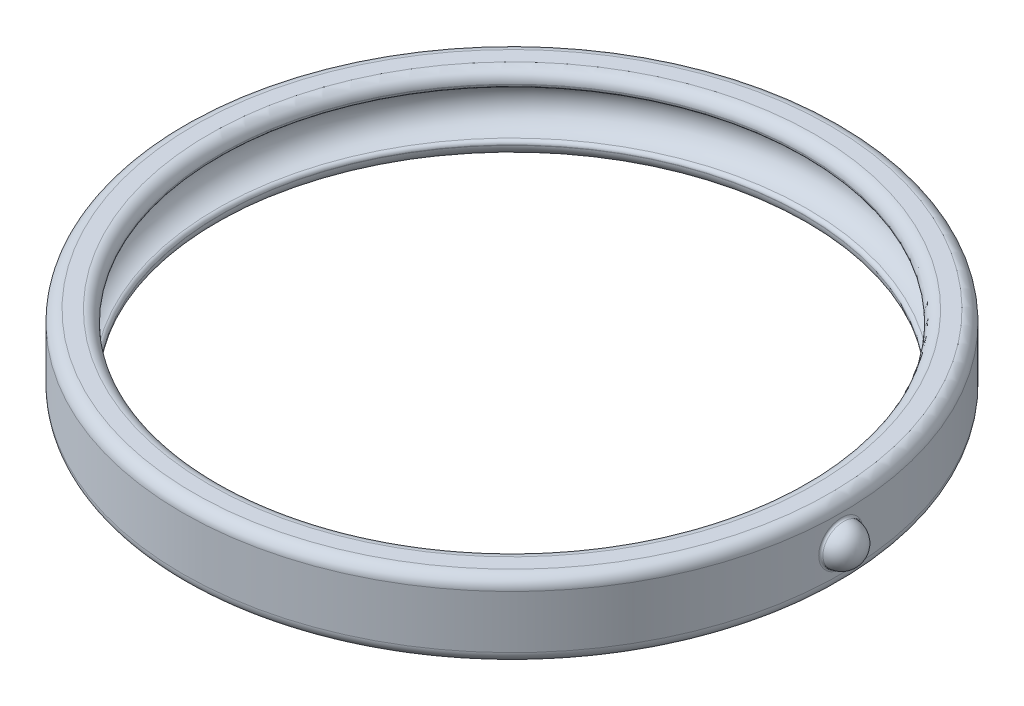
ISO-10303-21;
HEADER;
FILE_DESCRIPTION(('STEP AP214'),'2;1');
FILE_NAME('part.step','',(''),(''),'','','');
FILE_SCHEMA(('AUTOMOTIVE_DESIGN { 1 0 10303 214 1 1 1 1 }'));
ENDSEC;
DATA;
#1=APPLICATION_CONTEXT('core data for automotive mechanical design processes');
#2=APPLICATION_PROTOCOL_DEFINITION('international standard','automotive_design',2000,#1);
#3=PRODUCT_CONTEXT('',#1,'mechanical');
#4=PRODUCT('Part','Part','',(#3));
#5=PRODUCT_RELATED_PRODUCT_CATEGORY('part','',(#4));
#6=PRODUCT_DEFINITION_FORMATION('','',#4);
#7=PRODUCT_DEFINITION_CONTEXT('part definition',#1,'design');
#8=PRODUCT_DEFINITION('design','',#6,#7);
#9=PRODUCT_DEFINITION_SHAPE('','',#8);
#10=(LENGTH_UNIT() NAMED_UNIT(*) SI_UNIT(.MILLI.,.METRE.));
#11=(NAMED_UNIT(*) PLANE_ANGLE_UNIT() SI_UNIT($,.RADIAN.));
#12=(NAMED_UNIT(*) SI_UNIT($,.STERADIAN.) SOLID_ANGLE_UNIT());
#13=UNCERTAINTY_MEASURE_WITH_UNIT(LENGTH_MEASURE(1.E-05),#10,'distance_accuracy_value','');
#14=(GEOMETRIC_REPRESENTATION_CONTEXT(3) GLOBAL_UNCERTAINTY_ASSIGNED_CONTEXT((#13)) GLOBAL_UNIT_ASSIGNED_CONTEXT((#10,
#11,#12)) REPRESENTATION_CONTEXT('',''));
#15=CARTESIAN_POINT('',(0.,0.,0.));
#16=DIRECTION('',(0.,0.,1.));
#17=DIRECTION('',(1.,0.,0.));
#18=AXIS2_PLACEMENT_3D('',#15,#16,#17);
#19=CARTESIAN_POINT('',(0.,8.5,0.));
#20=DIRECTION('',(0.,-1.,0.));
#21=DIRECTION('',(0.,0.,-1.));
#22=AXIS2_PLACEMENT_3D('',#19,#20,#21);
#23=TOROIDAL_SURFACE('',#22,40.1,1.5);
#24=CARTESIAN_POINT('',(0.,8.5,0.));
#25=DIRECTION('',(0.,-1.,0.));
#26=DIRECTION('',(0.,0.,-1.));
#27=AXIS2_PLACEMENT_3D('',#24,#25,#26);
#28=CIRCLE('',#27,38.6);
#29=CARTESIAN_POINT('',(0.,8.5,-38.6));
#30=VERTEX_POINT('',#29);
#31=EDGE_CURVE('E150',#30,#30,#28,.T.);
#32=ORIENTED_EDGE('',*,*,#31,.T.);
#33=EDGE_LOOP('',(#32));
#34=FACE_BOUND('',#33,.T.);
#35=CARTESIAN_POINT('',(0.,10.,0.));
#36=DIRECTION('',(0.,-1.,0.));
#37=DIRECTION('',(0.,0.,-1.));
#38=AXIS2_PLACEMENT_3D('',#35,#36,#37);
#39=CIRCLE('',#38,40.1);
#40=CARTESIAN_POINT('',(0.,10.,-40.1));
#41=VERTEX_POINT('',#40);
#42=EDGE_CURVE('E117',#41,#41,#39,.T.);
#43=ORIENTED_EDGE('',*,*,#42,.F.);
#44=EDGE_LOOP('',(#43));
#45=FACE_BOUND('',#44,.T.);
#46=ADVANCED_FACE('F34',(#34,#45),#23,.T.);
#47=CARTESIAN_POINT('',(40.1,10.,0.));
#48=DIRECTION('',(0.,1.,0.));
#49=DIRECTION('',(0.,0.,1.));
#50=AXIS2_PLACEMENT_3D('',#47,#48,#49);
#51=PLANE('',#50);
#52=ORIENTED_EDGE('',*,*,#42,.T.);
#53=EDGE_LOOP('',(#52));
#54=FACE_BOUND('',#53,.T.);
#55=CARTESIAN_POINT('',(0.,10.,0.));
#56=DIRECTION('',(0.,-1.,0.));
#57=DIRECTION('',(0.,0.,-1.));
#58=AXIS2_PLACEMENT_3D('',#55,#56,#57);
#59=CIRCLE('',#58,42.1);
#60=CARTESIAN_POINT('',(0.,10.,-42.1));
#61=VERTEX_POINT('',#60);
#62=EDGE_CURVE('E120',#61,#61,#59,.T.);
#63=ORIENTED_EDGE('',*,*,#62,.F.);
#64=EDGE_LOOP('',(#63));
#65=FACE_BOUND('',#64,.T.);
#66=ADVANCED_FACE('F169',(#54,#65),#51,.T.);
#67=CARTESIAN_POINT('',(0.,8.5,0.));
#68=DIRECTION('',(0.,-1.,0.));
#69=DIRECTION('',(0.,0.,-1.));
#70=AXIS2_PLACEMENT_3D('',#67,#68,#69);
#71=TOROIDAL_SURFACE('',#70,42.1,1.5);
#72=ORIENTED_EDGE('',*,*,#62,.T.);
#73=EDGE_LOOP('',(#72));
#74=FACE_BOUND('',#73,.T.);
#75=CARTESIAN_POINT('',(0.,8.5,0.));
#76=DIRECTION('',(0.,-1.,0.));
#77=DIRECTION('',(0.,0.,-1.));
#78=AXIS2_PLACEMENT_3D('',#75,#76,#77);
#79=CIRCLE('',#78,43.6);
#80=CARTESIAN_POINT('',(0.,8.5,-43.6));
#81=VERTEX_POINT('',#80);
#82=EDGE_CURVE('E123',#81,#81,#79,.T.);
#83=ORIENTED_EDGE('',*,*,#82,.F.);
#84=EDGE_LOOP('',(#83));
#85=FACE_BOUND('',#84,.T.);
#86=ADVANCED_FACE('F91',(#74,#85),#71,.T.);
#87=CARTESIAN_POINT('',(0.,0.,0.));
#88=DIRECTION('',(0.,-1.,0.));
#89=DIRECTION('',(0.,0.,-1.));
#90=AXIS2_PLACEMENT_3D('',#87,#88,#89);
#91=CYLINDRICAL_SURFACE('',#90,43.6);
#92=CARTESIAN_POINT('',(43.5019077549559,4.99905918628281,-2.92301585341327));
#93=CARTESIAN_POINT('',(43.5194667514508,4.99914348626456,-2.66169334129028));
#94=CARTESIAN_POINT('',(43.7807684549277,4.99915486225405,-2.64382715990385));
#95=CARTESIAN_POINT('',(43.5019112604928,4.83461898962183,-2.92296352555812));
#96=CARTESIAN_POINT('',(43.5194696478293,4.84943830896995,-2.66164540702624));
#97=CARTESIAN_POINT('',(43.7807716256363,4.85143739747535,-2.64377983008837));
#98=CARTESIAN_POINT('',(43.5028475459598,4.67018419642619,-2.90912725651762));
#99=CARTESIAN_POINT('',(43.5202440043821,4.69969649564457,-2.64895931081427));
#100=CARTESIAN_POINT('',(43.7816184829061,4.70372478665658,-2.63126511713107));
#101=CARTESIAN_POINT('',(43.5064799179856,4.34599535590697,-2.85428616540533));
#102=CARTESIAN_POINT('',(43.5232447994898,4.40462910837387,-2.59872450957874));
#103=CARTESIAN_POINT('',(43.7849039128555,4.41250430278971,-2.5816621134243));
#104=CARTESIAN_POINT('',(43.5091759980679,4.18624129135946,-2.81328144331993));
#105=CARTESIAN_POINT('',(43.5254728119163,4.25922820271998,-2.56114915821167));
#106=CARTESIAN_POINT('',(43.7873424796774,4.26899641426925,-2.54457391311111));
#107=CARTESIAN_POINT('',(43.5160238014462,3.87595459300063,-2.70528719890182));
#108=CARTESIAN_POINT('',(43.5311240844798,3.97701276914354,-2.46229722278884));
#109=CARTESIAN_POINT('',(43.7935362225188,3.99026429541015,-2.44689462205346));
#110=CARTESIAN_POINT('',(43.520175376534,3.72542102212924,-2.63830032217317));
#111=CARTESIAN_POINT('',(43.5345496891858,3.84014431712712,-2.40097704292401));
#112=CARTESIAN_POINT('',(43.7972912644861,3.85503922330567,-2.38630592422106));
#113=CARTESIAN_POINT('',(43.5294677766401,3.43779599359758,-2.48025678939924));
#114=CARTESIAN_POINT('',(43.5422060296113,3.57882674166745,-2.25647546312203));
#115=CARTESIAN_POINT('',(43.8056961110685,3.596664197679,-2.24335774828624));
#116=CARTESIAN_POINT('',(43.5346086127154,3.30070468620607,-2.38919986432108));
#117=CARTESIAN_POINT('',(43.5464390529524,3.45435581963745,-2.17324148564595));
#118=CARTESIAN_POINT('',(43.8103459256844,3.47351437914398,-2.16099802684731));
#119=CARTESIAN_POINT('',(43.5453169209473,3.04348843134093,-2.18535683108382));
#120=CARTESIAN_POINT('',(43.5552441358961,3.22098684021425,-1.98712787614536));
#121=CARTESIAN_POINT('',(43.8200314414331,3.24245570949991,-1.97662484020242));
#122=CARTESIAN_POINT('',(43.5508853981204,2.92340546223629,-2.07251853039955));
#123=CARTESIAN_POINT('',(43.5598180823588,3.11213842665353,-1.88415772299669));
#124=CARTESIAN_POINT('',(43.8250680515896,3.13458456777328,-1.87456416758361));
#125=CARTESIAN_POINT('',(43.5618138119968,2.70395445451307,-1.82846036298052));
#126=CARTESIAN_POINT('',(43.5687840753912,2.91333565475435,-1.66167422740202));
#127=CARTESIAN_POINT('',(43.8349526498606,2.93745061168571,-1.6538169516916));
#128=CARTESIAN_POINT('',(43.5671737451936,2.6045867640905,-1.6972401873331));
#129=CARTESIAN_POINT('',(43.5731755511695,2.82341889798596,-1.54213970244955));
#130=CARTESIAN_POINT('',(43.8398006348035,2.84818811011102,-1.53513012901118));
#131=CARTESIAN_POINT('',(43.5771013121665,2.42905638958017,-1.41970137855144));
#132=CARTESIAN_POINT('',(43.5813026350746,2.66464020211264,-1.28952086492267));
#133=CARTESIAN_POINT('',(43.8487799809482,2.69050828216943,-1.28410013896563));
#134=CARTESIAN_POINT('',(43.5816664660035,2.35296579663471,-1.27333768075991));
#135=CARTESIAN_POINT('',(43.5850341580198,2.59589595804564,-1.15640753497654));
#136=CARTESIAN_POINT('',(43.8529090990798,2.62215571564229,-1.1517162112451));
#137=CARTESIAN_POINT('',(43.589472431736,2.22651850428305,-0.969995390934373));
#138=CARTESIAN_POINT('',(43.5914123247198,2.48166350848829,-0.880667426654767));
#139=CARTESIAN_POINT('',(43.8599694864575,2.50856746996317,-0.877347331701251));
#140=CARTESIAN_POINT('',(43.5927132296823,2.17616207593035,-0.813016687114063));
#141=CARTESIAN_POINT('',(43.5940563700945,2.4362264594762,-0.738084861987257));
#142=CARTESIAN_POINT('',(43.8629007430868,2.46333203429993,-0.735362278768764));
#143=CARTESIAN_POINT('',(43.5975124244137,2.10250722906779,-0.492567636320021));
#144=CARTESIAN_POINT('',(43.5979724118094,2.36974820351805,-0.447071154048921));
#145=CARTESIAN_POINT('',(43.8672415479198,2.39716751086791,-0.445520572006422));
#146=CARTESIAN_POINT('',(43.599067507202,2.07926210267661,-0.329085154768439));
#147=CARTESIAN_POINT('',(43.5992396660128,2.34879048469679,-0.298700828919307));
#148=CARTESIAN_POINT('',(43.8686480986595,2.37628629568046,-0.297652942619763));
#149=CARTESIAN_POINT('',(43.6003094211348,2.0606535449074,-0.000556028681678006));
#150=CARTESIAN_POINT('',(43.6002523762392,2.33200257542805,-0.000486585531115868));
#151=CARTESIAN_POINT('',(43.8697713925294,2.35957013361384,-0.00050292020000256));
#152=CARTESIAN_POINT('',(43.5999962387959,2.06529031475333,0.164490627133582));
#153=CARTESIAN_POINT('',(43.5999972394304,2.33618219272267,0.149271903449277));
#154=CARTESIAN_POINT('',(43.8694881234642,2.36373536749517,0.148779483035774));
#155=CARTESIAN_POINT('',(43.5975356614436,2.10233438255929,0.4915814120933));
#156=CARTESIAN_POINT('',(43.5979905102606,2.36960493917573,0.446208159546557));
#157=CARTESIAN_POINT('',(43.8672625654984,2.39701224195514,0.444628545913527));
#158=CARTESIAN_POINT('',(43.5953870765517,2.13475969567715,0.653623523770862));
#159=CARTESIAN_POINT('',(43.5962390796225,2.39884541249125,0.593301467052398));
#160=CARTESIAN_POINT('',(43.8653192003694,2.42614006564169,0.591193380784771));
#161=CARTESIAN_POINT('',(43.5894965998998,2.22648391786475,0.969970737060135));
#162=CARTESIAN_POINT('',(43.5914307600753,2.48165369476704,0.880666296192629));
#163=CARTESIAN_POINT('',(43.8599913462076,2.50853640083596,0.877325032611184));
#164=CARTESIAN_POINT('',(43.5857547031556,2.28578291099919,1.12427581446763));
#165=CARTESIAN_POINT('',(43.5883762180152,2.53517942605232,1.02087392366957));
#166=CARTESIAN_POINT('',(43.8566068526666,2.56180498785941,1.01689182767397));
#167=CARTESIAN_POINT('',(43.5770960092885,2.4296560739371,1.42080879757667));
#168=CARTESIAN_POINT('',(43.581297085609,2.66520697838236,1.29053579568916));
#169=CARTESIAN_POINT('',(43.8487751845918,2.69104698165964,1.28510178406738));
#170=CARTESIAN_POINT('',(43.572179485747,2.51422435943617,1.56303950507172));
#171=CARTESIAN_POINT('',(43.5772752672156,2.74164986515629,1.41995861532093));
#172=CARTESIAN_POINT('',(43.8443282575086,2.76701510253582,1.41374747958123));
#173=CARTESIAN_POINT('',(43.5643485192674,2.6580804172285,1.76410766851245));
#174=CARTESIAN_POINT('',(43.5708575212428,2.87189089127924,1.60313547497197));
#175=CARTESIAN_POINT('',(43.8372452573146,2.89624173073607,1.59561083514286));
#176=CARTESIAN_POINT('',(43.5616616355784,2.70887718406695,1.82909479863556));
#177=CARTESIAN_POINT('',(43.5686552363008,2.91787558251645,1.66234178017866));
#178=CARTESIAN_POINT('',(43.8348150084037,2.94187272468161,1.65439078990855));
#179=CARTESIAN_POINT('',(43.5562085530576,2.81585688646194,1.95464591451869));
#180=CARTESIAN_POINT('',(43.5641829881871,3.01476526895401,1.77676608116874));
#181=CARTESIAN_POINT('',(43.8298827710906,3.03797313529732,1.76795002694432));
#182=CARTESIAN_POINT('',(43.5534422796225,2.87204501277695,2.01520553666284));
#183=CARTESIAN_POINT('',(43.5619130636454,3.06566992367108,1.83198226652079));
#184=CARTESIAN_POINT('',(43.8273807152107,3.08844721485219,1.82272536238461));
#185=CARTESIAN_POINT('',(43.5451576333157,3.04781736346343,2.18922485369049));
#186=CARTESIAN_POINT('',(43.5551135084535,3.22492274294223,1.99064020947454));
#187=CARTESIAN_POINT('',(43.8198873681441,3.2463444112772,1.98012341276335));
#188=CARTESIAN_POINT('',(43.5396383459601,3.1748751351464,2.29539541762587));
#189=CARTESIAN_POINT('',(43.5505760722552,3.34016013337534,2.08758341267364));
#190=CARTESIAN_POINT('',(43.8148952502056,3.36048105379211,2.07615321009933));
#191=CARTESIAN_POINT('',(43.529233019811,3.44521187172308,2.48494338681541));
#192=CARTESIAN_POINT('',(43.5420138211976,3.58555675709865,2.26073375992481));
#193=CARTESIAN_POINT('',(43.8054837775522,3.60332591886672,2.24759671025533));
#194=CARTESIAN_POINT('',(43.5243469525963,3.58849010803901,2.5683218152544));
#195=CARTESIAN_POINT('',(43.537987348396,3.71571578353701,2.33699114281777));
#196=CARTESIAN_POINT('',(43.8010643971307,3.73203348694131,2.32301133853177));
#197=CARTESIAN_POINT('',(43.517912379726,3.81223119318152,2.67442351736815));
#198=CARTESIAN_POINT('',(43.5326806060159,3.91914349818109,2.43407613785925));
#199=CARTESIAN_POINT('',(43.7952444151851,3.93302124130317,2.41897885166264));
#200=CARTESIAN_POINT('',(43.5159172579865,3.88824853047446,2.70662025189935));
#201=CARTESIAN_POINT('',(43.5310347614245,3.98826060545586,2.46354004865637));
#202=CARTESIAN_POINT('',(43.7934398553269,4.0013080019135,2.44810035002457));
#203=CARTESIAN_POINT('',(43.5122778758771,4.04267788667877,2.76450867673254));
#204=CARTESIAN_POINT('',(43.5280318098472,4.12870071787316,2.51652144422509));
#205=CARTESIAN_POINT('',(43.7901480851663,4.14003267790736,2.50045962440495));
#206=CARTESIAN_POINT('',(43.5106333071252,4.12108773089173,2.79020608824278));
#207=CARTESIAN_POINT('',(43.5266741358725,4.20002781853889,2.54005014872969));
#208=CARTESIAN_POINT('',(43.7886605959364,4.21046863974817,2.52370257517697));
#209=CARTESIAN_POINT('',(43.5063015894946,4.35908201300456,2.85723787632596));
#210=CARTESIAN_POINT('',(43.5230984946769,4.4165119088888,2.60141248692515));
#211=CARTESIAN_POINT('',(43.7847426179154,4.42426011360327,2.58433189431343));
#212=CARTESIAN_POINT('',(43.5042091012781,4.52167769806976,2.88862844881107));
#213=CARTESIAN_POINT('',(43.5213686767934,4.56453621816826,2.63018486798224));
#214=CARTESIAN_POINT('',(43.7828499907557,4.57032064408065,2.61272423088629));
#215=CARTESIAN_POINT('',(43.5022856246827,4.78989725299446,2.91740030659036));
#216=CARTESIAN_POINT('',(43.5197791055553,4.80871182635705,2.65654718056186));
#217=CARTESIAN_POINT('',(43.7811102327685,4.81126363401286,2.63874797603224));
#218=CARTESIAN_POINT('',(43.5019088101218,4.89472501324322,2.92300013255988));
#219=CARTESIAN_POINT('',(43.5194676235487,4.90415767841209,2.66167893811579));
#220=CARTESIAN_POINT('',(43.7807694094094,4.90543094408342,2.64381294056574));
#221=CARTESIAN_POINT('',(43.5019066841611,5.10438219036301,2.9230318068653));
#222=CARTESIAN_POINT('',(43.5194658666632,5.09502949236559,2.6617079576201));
#223=CARTESIAN_POINT('',(43.7807674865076,5.09376705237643,2.64384158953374));
#224=CARTESIAN_POINT('',(43.5022813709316,5.20921160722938,2.91746368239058));
#225=CARTESIAN_POINT('',(43.5197755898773,5.1904768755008,2.65660525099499));
#226=CARTESIAN_POINT('',(43.7811063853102,5.1879358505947,2.63880529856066));
#227=CARTESIAN_POINT('',(43.5041968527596,5.47707533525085,2.88881223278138));
#228=CARTESIAN_POINT('',(43.5213585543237,5.43432856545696,2.63035326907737));
#229=CARTESIAN_POINT('',(43.7828389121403,5.42855919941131,2.61289046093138));
#230=CARTESIAN_POINT('',(43.5062794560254,5.6393214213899,2.8575715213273));
#231=CARTESIAN_POINT('',(43.5230801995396,5.58203467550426,2.60171828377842));
#232=CARTESIAN_POINT('',(43.7847225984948,5.57430568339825,2.58463367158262));
#233=CARTESIAN_POINT('',(43.5105919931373,5.87683119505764,2.79084949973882));
#234=CARTESIAN_POINT('',(43.5266400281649,5.79807891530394,2.54063925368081));
#235=CARTESIAN_POINT('',(43.7886232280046,5.78766192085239,2.52428453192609));
#236=CARTESIAN_POINT('',(43.5122294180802,5.95508549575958,2.7652699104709));
#237=CARTESIAN_POINT('',(43.5279918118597,5.86926480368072,2.51721834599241));
#238=CARTESIAN_POINT('',(43.7901042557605,5.85795815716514,2.50114814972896));
#239=CARTESIAN_POINT('',(43.5158534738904,6.10921966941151,2.70764413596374));
#240=CARTESIAN_POINT('',(43.5309821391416,6.00943717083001,2.46447706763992));
#241=CARTESIAN_POINT('',(43.7933821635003,5.99641766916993,2.44902643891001));
#242=CARTESIAN_POINT('',(43.5178404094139,6.1850974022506,2.67559230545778));
#243=CARTESIAN_POINT('',(43.5326212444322,6.07842775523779,2.43514559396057));
#244=CARTESIAN_POINT('',(43.7951793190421,6.06457902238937,2.42003600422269));
#245=CARTESIAN_POINT('',(43.5242372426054,6.40802142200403,2.57016600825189));
#246=CARTESIAN_POINT('',(43.5378969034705,6.28111345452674,2.33867818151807));
#247=CARTESIAN_POINT('',(43.8009651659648,6.26483280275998,2.32467938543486));
#248=CARTESIAN_POINT('',(43.5290894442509,6.55068516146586,2.48742857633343));
#249=CARTESIAN_POINT('',(43.5418955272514,6.41071581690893,2.26300643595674));
#250=CARTESIAN_POINT('',(43.8053539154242,6.39298836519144,2.24984452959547));
#251=CARTESIAN_POINT('',(43.5394272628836,6.82000227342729,2.29936559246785));
#252=CARTESIAN_POINT('',(43.5504024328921,6.65519081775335,2.09120971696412));
#253=CARTESIAN_POINT('',(43.8147043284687,6.63491729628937,2.07974417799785));
#254=CARTESIAN_POINT('',(43.544912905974,6.94665498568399,2.19403910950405));
#255=CARTESIAN_POINT('',(43.5549123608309,6.77006367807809,1.99503521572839));
#256=CARTESIAN_POINT('',(43.8196660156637,6.74869007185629,1.98447784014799));
#257=CARTESIAN_POINT('',(43.5531567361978,7.12205328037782,2.02135526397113));
#258=CARTESIAN_POINT('',(43.5616786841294,6.92898199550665,1.83759039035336));
#259=CARTESIAN_POINT('',(43.8271224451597,6.90625125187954,1.82828770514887));
#260=CARTESIAN_POINT('',(43.5559119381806,7.17817218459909,1.96123015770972));
#261=CARTESIAN_POINT('',(43.5639396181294,6.97982539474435,1.78276881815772));
#262=CARTESIAN_POINT('',(43.8296144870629,6.95666314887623,1.77390538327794));
#263=CARTESIAN_POINT('',(43.5613464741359,7.28507520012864,1.83657008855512));
#264=CARTESIAN_POINT('',(43.5683968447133,7.07664841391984,1.66915324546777));
#265=CARTESIAN_POINT('',(43.8345299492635,7.05269467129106,1.66115208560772));
#266=CARTESIAN_POINT('',(43.564025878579,7.33586439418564,1.77203942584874));
#267=CARTESIAN_POINT('',(43.5705931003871,7.1226277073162,1.61036095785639));
#268=CARTESIAN_POINT('',(43.8369534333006,7.09831886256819,1.60278499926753));
#269=CARTESIAN_POINT('',(43.5718411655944,7.47979523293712,1.57236425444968));
#270=CARTESIAN_POINT('',(43.5769982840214,7.2529403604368,1.42844746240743));
#271=CARTESIAN_POINT('',(43.844022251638,7.22761266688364,1.42218158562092));
#272=CARTESIAN_POINT('',(43.5767561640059,7.56454180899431,1.43109544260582));
#273=CARTESIAN_POINT('',(43.5810190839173,7.3295474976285,1.29989511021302));
#274=CARTESIAN_POINT('',(43.848467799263,7.30374094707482,1.29440591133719));
#275=CARTESIAN_POINT('',(43.5854460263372,7.7092333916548,1.13610332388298));
#276=CARTESIAN_POINT('',(43.5881240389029,7.46031905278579,1.03162533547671));
#277=CARTESIAN_POINT('',(43.8563276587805,7.43371813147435,1.02758964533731));
#278=CARTESIAN_POINT('',(43.5892176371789,7.76910780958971,0.982346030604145));
#279=CARTESIAN_POINT('',(43.5912029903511,7.51436604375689,0.891910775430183));
#280=CARTESIAN_POINT('',(43.8597390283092,7.48750362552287,0.888518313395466));
#281=CARTESIAN_POINT('',(43.5951826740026,7.86211715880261,0.667000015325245));
#282=CARTESIAN_POINT('',(43.5960723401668,7.5983365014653,0.605448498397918));
#283=CARTESIAN_POINT('',(43.8651343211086,7.57105439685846,0.603292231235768));
#284=CARTESIAN_POINT('',(43.59737608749,7.89525187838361,0.505411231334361));
#285=CARTESIAN_POINT('',(43.5978603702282,7.62821736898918,0.458763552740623));
#286=CARTESIAN_POINT('',(43.8671182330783,7.60081948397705,0.457137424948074));
#287=CARTESIAN_POINT('',(43.5999399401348,7.93387279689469,0.178750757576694));
#288=CARTESIAN_POINT('',(43.5999513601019,7.66306321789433,0.162214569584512));
#289=CARTESIAN_POINT('',(43.8694372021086,7.63551285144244,0.161677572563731));
#290=CARTESIAN_POINT('',(43.600307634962,7.9393173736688,0.0136741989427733));
#291=CARTESIAN_POINT('',(43.6002509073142,7.66797101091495,0.0124284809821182));
#292=CARTESIAN_POINT('',(43.8697697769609,7.64040374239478,0.012368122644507));
#293=CARTESIAN_POINT('',(43.5991715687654,7.92229914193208,-0.315048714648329));
#294=CARTESIAN_POINT('',(43.5993245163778,7.65261790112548,-0.285960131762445));
#295=CARTESIAN_POINT('',(43.8687422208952,7.62511617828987,-0.284957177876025));
#296=CARTESIAN_POINT('',(43.5976678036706,7.89983627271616,-0.478695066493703));
#297=CARTESIAN_POINT('',(43.5980991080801,7.6323657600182,-0.434476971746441));
#298=CARTESIAN_POINT('',(43.8673820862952,7.60493766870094,-0.432973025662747));
#299=CARTESIAN_POINT('',(43.5929568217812,7.82761378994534,-0.799967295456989));
#300=CARTESIAN_POINT('',(43.5942551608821,7.56718165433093,-0.726232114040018));
#301=CARTESIAN_POINT('',(43.8631210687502,7.54005984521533,-0.723559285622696));
#302=CARTESIAN_POINT('',(43.5897490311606,7.7778449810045,-0.957591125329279));
#303=CARTESIAN_POINT('',(43.5916381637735,7.5222762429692,-0.869396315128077));
#304=CARTESIAN_POINT('',(43.8602196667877,7.49535227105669,-0.866127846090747));
#305=CARTESIAN_POINT('',(43.5819904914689,7.65239075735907,-1.26228017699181));
#306=CARTESIAN_POINT('',(43.5852990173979,7.40894420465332,-1.14635238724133));
#307=CARTESIAN_POINT('',(43.8532021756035,7.38265610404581,-1.14171485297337));
#308=CARTESIAN_POINT('',(43.5774397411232,7.5767053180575,-1.40934538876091));
#309=CARTESIAN_POINT('',(43.5815794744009,7.34056863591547,-1.28009876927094));
#310=CARTESIAN_POINT('',(43.849086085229,7.31466748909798,-1.27473329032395));
#311=CARTESIAN_POINT('',(43.5675109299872,7.40158132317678,-1.68864952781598));
#312=CARTESIAN_POINT('',(43.5734517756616,7.18216299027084,-1.53431544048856));
#313=CARTESIAN_POINT('',(43.8401056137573,7.15735271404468,-1.52735999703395));
#314=CARTESIAN_POINT('',(43.5621333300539,7.30215598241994,-1.820896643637));
#315=CARTESIAN_POINT('',(43.5690460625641,7.09219752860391,-1.65478124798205));
#316=CARTESIAN_POINT('',(43.8352416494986,7.06803842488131,-1.64697567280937));
#317=CARTESIAN_POINT('',(43.551156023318,7.08231781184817,-2.06688138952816));
#318=CARTESIAN_POINT('',(43.5600403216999,6.89304949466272,-1.87901463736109));
#319=CARTESIAN_POINT('',(43.825312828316,6.87055667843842,-1.86946545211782));
#320=CARTESIAN_POINT('',(43.5455563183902,6.96190515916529,-2.1806191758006));
#321=CARTESIAN_POINT('',(43.555440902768,6.78390533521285,-1.98280307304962));
#322=CARTESIAN_POINT('',(43.8202479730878,6.7623893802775,-1.97233969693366));
#323=CARTESIAN_POINT('',(43.5347789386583,6.70372866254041,-2.3861314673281));
#324=CARTESIAN_POINT('',(43.5465792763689,6.54966966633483,-2.1704370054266));
#325=CARTESIAN_POINT('',(43.8104999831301,6.53046812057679,-2.15822270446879));
#326=CARTESIAN_POINT('',(43.5296005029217,6.56599730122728,-2.47794618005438));
#327=CARTESIAN_POINT('',(43.5423153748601,6.42461955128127,-2.25436274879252));
#328=CARTESIAN_POINT('',(43.8058161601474,6.40674333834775,-2.24126783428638));
#329=CARTESIAN_POINT('',(43.5202406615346,6.27690763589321,-2.63724230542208));
#330=CARTESIAN_POINT('',(43.5346035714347,6.16197364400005,-2.40000822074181));
#331=CARTESIAN_POINT('',(43.7973503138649,6.14705262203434,-2.3853489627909));
#332=CARTESIAN_POINT('',(43.5160592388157,6.12554956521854,-2.70472413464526));
#333=CARTESIAN_POINT('',(43.53115334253,6.02435598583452,-2.46178156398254));
#334=CARTESIAN_POINT('',(43.7935682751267,6.0110868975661,-2.44638533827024));
#335=CARTESIAN_POINT('',(43.5091789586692,5.813993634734,-2.81323894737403));
#336=CARTESIAN_POINT('',(43.5254752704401,5.74098607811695,-2.56111003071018));
#337=CARTESIAN_POINT('',(43.7873451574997,5.73121462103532,-2.54453547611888));
#338=CARTESIAN_POINT('',(43.506475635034,5.65382403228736,-2.85435167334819));
#339=CARTESIAN_POINT('',(43.5232412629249,5.59520674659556,-2.59878449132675));
#340=CARTESIAN_POINT('',(43.7849000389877,5.58733345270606,-2.58172136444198));
#341=CARTESIAN_POINT('',(43.5028382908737,5.32878748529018,-2.90926612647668));
#342=CARTESIAN_POINT('',(43.5202363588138,5.29936763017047,-2.6490865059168));
#343=CARTESIAN_POINT('',(43.7816101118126,5.2953514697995,-2.63139072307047));
#344=CARTESIAN_POINT('',(43.5019042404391,5.16392062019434,-2.92306831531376));
#345=CARTESIAN_POINT('',(43.5194638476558,5.14923199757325,-2.66174139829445));
#346=CARTESIAN_POINT('',(43.7807652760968,5.14725072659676,-2.64387461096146));
#347=CARTESIAN_POINT('',(43.5019077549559,4.99905918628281,-2.92301585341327));
#348=CARTESIAN_POINT('',(43.5194667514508,4.99914348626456,-2.66169334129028));
#349=CARTESIAN_POINT('',(43.7807684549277,4.99915486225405,-2.64382715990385));
#350=(BOUNDED_SURFACE() B_SPLINE_SURFACE(3,2,((#92,#93,#94),(#95,#96,#97),(#98,#99,#100),(#101,
#102,#103),(#104,#105,#106),(#107,#108,#109),(#110,#111,#112),(#113,#114,#115),(#116,#117,#118),
(#119,#120,#121),(#122,#123,#124),(#125,#126,#127),(#128,#129,#130),(#131,#132,#133),(#134,#135,
#136),(#137,#138,#139),(#140,#141,#142),(#143,#144,#145),(#146,#147,#148),(#149,#150,#151),
(#152,#153,#154),(#155,#156,#157),(#158,#159,#160),(#161,#162,#163),(#164,#165,#166),(#167,#168,
#169),(#170,#171,#172),(#173,#174,#175),(#176,#177,#178),(#179,#180,#181),(#182,#183,#184),
(#185,#186,#187),(#188,#189,#190),(#191,#192,#193),(#194,#195,#196),(#197,#198,#199),(#200,#201,
#202),(#203,#204,#205),(#206,#207,#208),(#209,#210,#211),(#212,#213,#214),(#215,#216,#217),
(#218,#219,#220),(#221,#222,#223),(#224,#225,#226),(#227,#228,#229),(#230,#231,#232),(#233,#234,
#235),(#236,#237,#238),(#239,#240,#241),(#242,#243,#244),(#245,#246,#247),(#248,#249,#250),
(#251,#252,#253),(#254,#255,#256),(#257,#258,#259),(#260,#261,#262),(#263,#264,#265),(#266,#267,
#268),(#269,#270,#271),(#272,#273,#274),(#275,#276,#277),(#278,#279,#280),(#281,#282,#283),
(#284,#285,#286),(#287,#288,#289),(#290,#291,#292),(#293,#294,#295),(#296,#297,#298),(#299,#300,
#301),(#302,#303,#304),(#305,#306,#307),(#308,#309,#310),(#311,#312,#313),(#314,#315,#316),
(#317,#318,#319),(#320,#321,#322),(#323,#324,#325),(#326,#327,#328),(#329,#330,#331),(#332,#333,
#334),(#335,#336,#337),(#338,#339,#340),(#341,#342,#343),(#344,#345,#346),(#347,#348,#349)),
.UNSPECIFIED.,.T.,.F.,.F.) B_SPLINE_SURFACE_WITH_KNOTS((4,2,2,2,2,2,2,2,2,2,2,2,2,2,2,2,2,2,2,2,
2,2,2,2,2,2,2,2,2,2,2,2,2,2,2,2,2,2,2,2,2,2,4),(3,3),(0.,0.492736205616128,0.985470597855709,
1.4781548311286,1.97084457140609,2.46472988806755,2.95862350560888,3.45403161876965,
3.949444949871,4.44583047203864,4.94221957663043,5.43893073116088,5.93564343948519,
6.43224057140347,6.68062970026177,6.92926042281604,7.42516527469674,7.92104786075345,
8.16878195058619,8.41629720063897,8.91051840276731,9.22491900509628,9.53931884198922,
10.0324428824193,10.2794048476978,10.5265831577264,11.0199340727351,11.5133053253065,
11.7608341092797,12.0081246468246,12.5025316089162,12.9983322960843,13.4941369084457,
13.9906865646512,14.4872373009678,14.9839553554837,15.4806738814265,15.9771165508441,
16.4735550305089,16.9690759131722,17.4645883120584,17.9585950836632,18.4525935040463),(0.,1.),
.UNSPECIFIED.) GEOMETRIC_REPRESENTATION_ITEM() RATIONAL_B_SPLINE_SURFACE(((1.,0.753308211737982,
1.),(1.,0.753307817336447,1.),(1.,0.753202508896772,1.),(1.,0.752793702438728,1.),(1.,
0.752490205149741,1.),(1.,0.751718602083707,1.),(1.,0.751250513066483,1.),(1.,0.750201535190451,
1.),(1.,0.749620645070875,1.),(1.,0.748409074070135,1.),(1.,0.747778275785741,1.),(1.,
0.746538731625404,1.),(1.,0.745929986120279,1.),(1.,0.744801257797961,1.),(1.,0.74428155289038,
1.),(1.,0.74339222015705,1.),(1.,0.743022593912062,1.),(1.,0.742475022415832,1.),(1.,
0.742297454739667,1.),(1.,0.742155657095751,1.),(1.,0.742191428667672,1.),(1.,0.742472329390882,
1.),(1.,0.742717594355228,1.),(1.,0.743389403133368,1.),(1.,0.743815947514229,1.),(1.,
0.744801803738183,1.),(1.,0.745361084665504,1.),(1.,0.746250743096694,1.),(1.,0.746555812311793,
1.),(1.,0.747174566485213,1.),(1.,0.747488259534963,1.),(1.,0.748427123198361,1.),(1.,
0.749051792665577,1.),(1.,0.750228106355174,1.),(1.,0.750779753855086,1.),(1.,0.751505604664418,
1.),(1.,0.75173054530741,1.),(1.,0.752140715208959,1.),(1.,0.75232597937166,1.),(1.,
0.752813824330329,1.),(1.,0.753049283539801,1.),(1.,0.753265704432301,1.),(1.,0.75330809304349,
1.),(1.,0.753308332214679,1.),(1.,0.753266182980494,1.),(1.,0.753050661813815,1.),(1.,
0.752816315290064,1.),(1.,0.75233063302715,1.),(1.,0.752146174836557,1.),(1.,0.751737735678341,
1.),(1.,0.751513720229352,1.),(1.,0.750792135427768,1.),(1.,0.750244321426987,1.),(1.,
0.749075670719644,1.),(1.,0.748454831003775,1.),(1.,0.747520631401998,1.),(1.,0.747208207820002,
1.),(1.,0.746591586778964,1.),(1.,0.746287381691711,1.),(1.,0.745399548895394,1.),(1.,
0.744840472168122,1.),(1.,0.743851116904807,1.),(1.,0.74342120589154,1.),(1.,0.742740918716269,
1.),(1.,0.742490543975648,1.),(1.,0.742197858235,1.),(1.,0.742155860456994,1.),(1.,
0.742285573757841,1.),(1.,0.742457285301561,1.),(1.,0.742994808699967,1.),(1.,0.743360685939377,
1.),(1.,0.744244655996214,1.),(1.,0.744762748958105,1.),(1.,0.745891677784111,1.),(1.,
0.746502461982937,1.),(1.,0.747747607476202,1.),(1.,0.748381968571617,1.),(1.,0.749601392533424,
1.),(1.,0.750186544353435,1.),(1.,0.751243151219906,1.),(1.,0.751714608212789,1.),(1.,
0.752489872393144,1.),(1.,0.752794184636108,1.),(1.,0.753203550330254,1.),(1.,0.753308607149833,
1.),(1.,0.753308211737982,1.))) REPRESENTATION_ITEM('') SURFACE());
#351=CARTESIAN_POINT('',(43.5019077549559,4.99905918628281,-2.92301585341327));
#352=CARTESIAN_POINT('',(43.5019112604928,4.83461898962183,-2.92296352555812));
#353=CARTESIAN_POINT('',(43.5028475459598,4.67018419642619,-2.90912725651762));
#354=CARTESIAN_POINT('',(43.5064799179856,4.34599535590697,-2.85428616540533));
#355=CARTESIAN_POINT('',(43.5091759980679,4.18624129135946,-2.81328144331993));
#356=CARTESIAN_POINT('',(43.5160238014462,3.87595459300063,-2.70528719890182));
#357=CARTESIAN_POINT('',(43.520175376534,3.72542102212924,-2.63830032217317));
#358=CARTESIAN_POINT('',(43.5294677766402,3.43779599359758,-2.48025678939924));
#359=CARTESIAN_POINT('',(43.5346086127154,3.30070468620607,-2.38919986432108));
#360=CARTESIAN_POINT('',(43.5453169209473,3.04348843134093,-2.18535683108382));
#361=CARTESIAN_POINT('',(43.5508853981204,2.92340546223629,-2.07251853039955));
#362=CARTESIAN_POINT('',(43.5618138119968,2.70395445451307,-1.82846036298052));
#363=CARTESIAN_POINT('',(43.5671737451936,2.6045867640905,-1.6972401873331));
#364=CARTESIAN_POINT('',(43.5771013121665,2.42905638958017,-1.41970137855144));
#365=CARTESIAN_POINT('',(43.5816664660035,2.35296579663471,-1.27333768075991));
#366=CARTESIAN_POINT('',(43.589472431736,2.22651850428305,-0.969995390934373));
#367=CARTESIAN_POINT('',(43.5927132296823,2.17616207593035,-0.813016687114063));
#368=CARTESIAN_POINT('',(43.5975124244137,2.10250722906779,-0.492567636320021));
#369=CARTESIAN_POINT('',(43.599067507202,2.07926210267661,-0.32908515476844));
#370=CARTESIAN_POINT('',(43.6003094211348,2.0606535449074,-0.00055602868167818));
#371=CARTESIAN_POINT('',(43.5999962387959,2.06529031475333,0.164490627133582));
#372=CARTESIAN_POINT('',(43.5975356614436,2.10233438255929,0.4915814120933));
#373=CARTESIAN_POINT('',(43.5953870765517,2.13475969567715,0.653623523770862));
#374=CARTESIAN_POINT('',(43.5894965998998,2.22648391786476,0.969970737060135));
#375=CARTESIAN_POINT('',(43.5857547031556,2.28578291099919,1.12427581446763));
#376=CARTESIAN_POINT('',(43.5770960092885,2.4296560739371,1.42080879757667));
#377=CARTESIAN_POINT('',(43.572179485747,2.51422435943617,1.56303950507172));
#378=CARTESIAN_POINT('',(43.5643485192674,2.6580804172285,1.76410766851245));
#379=CARTESIAN_POINT('',(43.5616616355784,2.70887718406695,1.82909479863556));
#380=CARTESIAN_POINT('',(43.5562085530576,2.81585688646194,1.95464591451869));
#381=CARTESIAN_POINT('',(43.5534422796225,2.87204501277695,2.01520553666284));
#382=CARTESIAN_POINT('',(43.5451576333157,3.04781736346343,2.18922485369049));
#383=CARTESIAN_POINT('',(43.5396383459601,3.1748751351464,2.29539541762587));
#384=CARTESIAN_POINT('',(43.529233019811,3.44521187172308,2.48494338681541));
#385=CARTESIAN_POINT('',(43.5243469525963,3.58849010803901,2.5683218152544));
#386=CARTESIAN_POINT('',(43.517912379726,3.81223119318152,2.67442351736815));
#387=CARTESIAN_POINT('',(43.5159172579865,3.88824853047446,2.70662025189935));
#388=CARTESIAN_POINT('',(43.5122778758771,4.04267788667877,2.76450867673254));
#389=CARTESIAN_POINT('',(43.5106333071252,4.12108773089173,2.79020608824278));
#390=CARTESIAN_POINT('',(43.5063015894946,4.35908201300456,2.85723787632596));
#391=CARTESIAN_POINT('',(43.5042091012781,4.52167769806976,2.88862844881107));
#392=CARTESIAN_POINT('',(43.5022856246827,4.78989725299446,2.91740030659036));
#393=CARTESIAN_POINT('',(43.5019088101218,4.89472501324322,2.92300013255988));
#394=CARTESIAN_POINT('',(43.5019066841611,5.10438219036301,2.9230318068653));
#395=CARTESIAN_POINT('',(43.5022813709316,5.20921160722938,2.91746368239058));
#396=CARTESIAN_POINT('',(43.5041968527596,5.47707533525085,2.88881223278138));
#397=CARTESIAN_POINT('',(43.5062794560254,5.6393214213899,2.8575715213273));
#398=CARTESIAN_POINT('',(43.5105919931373,5.87683119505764,2.79084949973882));
#399=CARTESIAN_POINT('',(43.5122294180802,5.95508549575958,2.7652699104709));
#400=CARTESIAN_POINT('',(43.5158534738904,6.10921966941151,2.70764413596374));
#401=CARTESIAN_POINT('',(43.5178404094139,6.1850974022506,2.67559230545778));
#402=CARTESIAN_POINT('',(43.5242372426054,6.40802142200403,2.57016600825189));
#403=CARTESIAN_POINT('',(43.5290894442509,6.55068516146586,2.48742857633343));
#404=CARTESIAN_POINT('',(43.5394272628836,6.82000227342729,2.29936559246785));
#405=CARTESIAN_POINT('',(43.544912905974,6.94665498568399,2.19403910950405));
#406=CARTESIAN_POINT('',(43.5531567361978,7.12205328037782,2.02135526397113));
#407=CARTESIAN_POINT('',(43.5559119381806,7.17817218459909,1.96123015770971));
#408=CARTESIAN_POINT('',(43.5613464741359,7.28507520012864,1.83657008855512));
#409=CARTESIAN_POINT('',(43.564025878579,7.33586439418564,1.77203942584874));
#410=CARTESIAN_POINT('',(43.5718411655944,7.47979523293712,1.57236425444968));
#411=CARTESIAN_POINT('',(43.5767561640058,7.56454180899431,1.43109544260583));
#412=CARTESIAN_POINT('',(43.5854460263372,7.7092333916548,1.13610332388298));
#413=CARTESIAN_POINT('',(43.5892176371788,7.76910780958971,0.982346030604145));
#414=CARTESIAN_POINT('',(43.5951826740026,7.8621171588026,0.667000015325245));
#415=CARTESIAN_POINT('',(43.59737608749,7.89525187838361,0.505411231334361));
#416=CARTESIAN_POINT('',(43.5999399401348,7.93387279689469,0.178750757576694));
#417=CARTESIAN_POINT('',(43.600307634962,7.9393173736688,0.013674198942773));
#418=CARTESIAN_POINT('',(43.5991715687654,7.92229914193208,-0.315048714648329));
#419=CARTESIAN_POINT('',(43.5976678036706,7.89983627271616,-0.478695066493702));
#420=CARTESIAN_POINT('',(43.5929568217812,7.82761378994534,-0.799967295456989));
#421=CARTESIAN_POINT('',(43.5897490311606,7.7778449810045,-0.957591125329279));
#422=CARTESIAN_POINT('',(43.5819904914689,7.65239075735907,-1.26228017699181));
#423=CARTESIAN_POINT('',(43.5774397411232,7.5767053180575,-1.40934538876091));
#424=CARTESIAN_POINT('',(43.5675109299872,7.40158132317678,-1.68864952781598));
#425=CARTESIAN_POINT('',(43.5621333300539,7.30215598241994,-1.82089664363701));
#426=CARTESIAN_POINT('',(43.551156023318,7.08231781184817,-2.06688138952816));
#427=CARTESIAN_POINT('',(43.5455563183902,6.96190515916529,-2.1806191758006));
#428=CARTESIAN_POINT('',(43.5347789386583,6.70372866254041,-2.3861314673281));
#429=CARTESIAN_POINT('',(43.5296005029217,6.56599730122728,-2.47794618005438));
#430=CARTESIAN_POINT('',(43.5202406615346,6.27690763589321,-2.63724230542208));
#431=CARTESIAN_POINT('',(43.5160592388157,6.12554956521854,-2.70472413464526));
#432=CARTESIAN_POINT('',(43.5091789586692,5.813993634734,-2.81323894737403));
#433=CARTESIAN_POINT('',(43.506475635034,5.65382403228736,-2.85435167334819));
#434=CARTESIAN_POINT('',(43.5028382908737,5.32878748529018,-2.90926612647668));
#435=CARTESIAN_POINT('',(43.5019042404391,5.16392062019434,-2.92306831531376));
#436=CARTESIAN_POINT('',(43.5019077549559,4.99905918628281,-2.92301585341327));
#437=B_SPLINE_CURVE_WITH_KNOTS('',3,(#351,#352,#353,#354,#355,#356,#357,#358,#359,#360,#361,
#362,#363,#364,#365,#366,#367,#368,#369,#370,#371,#372,#373,#374,#375,#376,#377,#378,#379,#380,
#381,#382,#383,#384,#385,#386,#387,#388,#389,#390,#391,#392,#393,#394,#395,#396,#397,#398,#399,
#400,#401,#402,#403,#404,#405,#406,#407,#408,#409,#410,#411,#412,#413,#414,#415,#416,#417,#418,
#419,#420,#421,#422,#423,#424,#425,#426,#427,#428,#429,#430,#431,#432,#433,#434,#435,#436),
.UNSPECIFIED.,.T.,.F.,(4,2,2,2,2,2,2,2,2,2,2,2,2,2,2,2,2,2,2,2,2,2,2,2,2,2,2,2,2,2,2,2,2,2,2,2,
2,2,2,2,2,2,4),(0.,0.492736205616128,0.985470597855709,1.4781548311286,1.97084457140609,
2.46472988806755,2.95862350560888,3.45403161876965,3.949444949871,4.44583047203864,
4.94221957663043,5.43893073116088,5.93564343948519,6.43224057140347,6.68062970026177,
6.92926042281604,7.42516527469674,7.92104786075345,8.16878195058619,8.41629720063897,
8.91051840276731,9.22491900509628,9.53931884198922,10.0324428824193,10.2794048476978,
10.5265831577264,11.0199340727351,11.5133053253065,11.7608341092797,12.0081246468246,
12.5025316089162,12.9983322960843,13.4941369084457,13.9906865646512,14.4872373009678,
14.9839553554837,15.4806738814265,15.9771165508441,16.4735550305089,16.9690759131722,
17.4645883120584,17.9585950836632,18.4525935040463),.UNSPECIFIED.);
#438=CARTESIAN_POINT('',(43.5019077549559,4.99905918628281,-2.92301585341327));
#439=VERTEX_POINT('',#438);
#440=EDGE_CURVE('E44',#439,#439,#437,.T.);
#441=ORIENTED_EDGE('',*,*,#440,.T.);
#442=EDGE_LOOP('',(#441));
#443=FACE_BOUND('',#442,.T.);
#444=CARTESIAN_POINT('',(-43.5019077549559,4.99905918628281,2.92301585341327));
#445=CARTESIAN_POINT('',(-43.5194667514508,4.99914348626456,2.66169334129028));
#446=CARTESIAN_POINT('',(-43.7807684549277,4.99915486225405,2.64382715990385));
#447=CARTESIAN_POINT('',(-43.5019112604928,4.83461898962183,2.92296352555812));
#448=CARTESIAN_POINT('',(-43.5194696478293,4.84943830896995,2.66164540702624));
#449=CARTESIAN_POINT('',(-43.7807716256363,4.85143739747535,2.64377983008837));
#450=CARTESIAN_POINT('',(-43.5028475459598,4.67018419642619,2.90912725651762));
#451=CARTESIAN_POINT('',(-43.5202440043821,4.69969649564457,2.64895931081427));
#452=CARTESIAN_POINT('',(-43.7816184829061,4.70372478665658,2.63126511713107));
#453=CARTESIAN_POINT('',(-43.5064799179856,4.34599535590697,2.85428616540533));
#454=CARTESIAN_POINT('',(-43.5232447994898,4.40462910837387,2.59872450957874));
#455=CARTESIAN_POINT('',(-43.7849039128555,4.41250430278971,2.5816621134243));
#456=CARTESIAN_POINT('',(-43.5091759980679,4.18624129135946,2.81328144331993));
#457=CARTESIAN_POINT('',(-43.5254728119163,4.25922820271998,2.56114915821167));
#458=CARTESIAN_POINT('',(-43.7873424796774,4.26899641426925,2.54457391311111));
#459=CARTESIAN_POINT('',(-43.5160238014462,3.87595459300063,2.70528719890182));
#460=CARTESIAN_POINT('',(-43.5311240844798,3.97701276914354,2.46229722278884));
#461=CARTESIAN_POINT('',(-43.7935362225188,3.99026429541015,2.44689462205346));
#462=CARTESIAN_POINT('',(-43.520175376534,3.72542102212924,2.63830032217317));
#463=CARTESIAN_POINT('',(-43.5345496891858,3.84014431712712,2.40097704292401));
#464=CARTESIAN_POINT('',(-43.7972912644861,3.85503922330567,2.38630592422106));
#465=CARTESIAN_POINT('',(-43.5294677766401,3.43779599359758,2.48025678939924));
#466=CARTESIAN_POINT('',(-43.5422060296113,3.57882674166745,2.25647546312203));
#467=CARTESIAN_POINT('',(-43.8056961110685,3.596664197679,2.24335774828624));
#468=CARTESIAN_POINT('',(-43.5346086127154,3.30070468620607,2.38919986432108));
#469=CARTESIAN_POINT('',(-43.5464390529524,3.45435581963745,2.17324148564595));
#470=CARTESIAN_POINT('',(-43.8103459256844,3.47351437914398,2.16099802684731));
#471=CARTESIAN_POINT('',(-43.5453169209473,3.04348843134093,2.18535683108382));
#472=CARTESIAN_POINT('',(-43.5552441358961,3.22098684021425,1.98712787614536));
#473=CARTESIAN_POINT('',(-43.8200314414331,3.24245570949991,1.97662484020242));
#474=CARTESIAN_POINT('',(-43.5508853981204,2.92340546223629,2.07251853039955));
#475=CARTESIAN_POINT('',(-43.5598180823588,3.11213842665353,1.88415772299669));
#476=CARTESIAN_POINT('',(-43.8250680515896,3.13458456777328,1.87456416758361));
#477=CARTESIAN_POINT('',(-43.5618138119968,2.70395445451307,1.82846036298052));
#478=CARTESIAN_POINT('',(-43.5687840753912,2.91333565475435,1.66167422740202));
#479=CARTESIAN_POINT('',(-43.8349526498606,2.93745061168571,1.6538169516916));
#480=CARTESIAN_POINT('',(-43.5671737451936,2.6045867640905,1.6972401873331));
#481=CARTESIAN_POINT('',(-43.5731755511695,2.82341889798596,1.54213970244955));
#482=CARTESIAN_POINT('',(-43.8398006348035,2.84818811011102,1.53513012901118));
#483=CARTESIAN_POINT('',(-43.5771013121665,2.42905638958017,1.41970137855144));
#484=CARTESIAN_POINT('',(-43.5813026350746,2.66464020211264,1.28952086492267));
#485=CARTESIAN_POINT('',(-43.8487799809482,2.69050828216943,1.28410013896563));
#486=CARTESIAN_POINT('',(-43.5816664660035,2.35296579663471,1.27333768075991));
#487=CARTESIAN_POINT('',(-43.5850341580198,2.59589595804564,1.15640753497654));
#488=CARTESIAN_POINT('',(-43.8529090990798,2.62215571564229,1.1517162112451));
#489=CARTESIAN_POINT('',(-43.589472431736,2.22651850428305,0.969995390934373));
#490=CARTESIAN_POINT('',(-43.5914123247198,2.48166350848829,0.880667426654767));
#491=CARTESIAN_POINT('',(-43.8599694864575,2.50856746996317,0.877347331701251));
#492=CARTESIAN_POINT('',(-43.5927132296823,2.17616207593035,0.813016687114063));
#493=CARTESIAN_POINT('',(-43.5940563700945,2.4362264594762,0.738084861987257));
#494=CARTESIAN_POINT('',(-43.8629007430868,2.46333203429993,0.735362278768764));
#495=CARTESIAN_POINT('',(-43.5975124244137,2.10250722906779,0.492567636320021));
#496=CARTESIAN_POINT('',(-43.5979724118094,2.36974820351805,0.447071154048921));
#497=CARTESIAN_POINT('',(-43.8672415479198,2.39716751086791,0.445520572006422));
#498=CARTESIAN_POINT('',(-43.599067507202,2.07926210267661,0.329085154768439));
#499=CARTESIAN_POINT('',(-43.5992396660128,2.34879048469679,0.298700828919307));
#500=CARTESIAN_POINT('',(-43.8686480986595,2.37628629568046,0.297652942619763));
#501=CARTESIAN_POINT('',(-43.6003094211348,2.0606535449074,0.000556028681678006));
#502=CARTESIAN_POINT('',(-43.6002523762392,2.33200257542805,0.000486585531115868));
#503=CARTESIAN_POINT('',(-43.8697713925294,2.35957013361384,0.00050292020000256));
#504=CARTESIAN_POINT('',(-43.5999962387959,2.06529031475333,-0.164490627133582));
#505=CARTESIAN_POINT('',(-43.5999972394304,2.33618219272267,-0.149271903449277));
#506=CARTESIAN_POINT('',(-43.8694881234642,2.36373536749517,-0.148779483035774));
#507=CARTESIAN_POINT('',(-43.5975356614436,2.10233438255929,-0.4915814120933));
#508=CARTESIAN_POINT('',(-43.5979905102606,2.36960493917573,-0.446208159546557));
#509=CARTESIAN_POINT('',(-43.8672625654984,2.39701224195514,-0.444628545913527));
#510=CARTESIAN_POINT('',(-43.5953870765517,2.13475969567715,-0.653623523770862));
#511=CARTESIAN_POINT('',(-43.5962390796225,2.39884541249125,-0.593301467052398));
#512=CARTESIAN_POINT('',(-43.8653192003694,2.42614006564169,-0.591193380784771));
#513=CARTESIAN_POINT('',(-43.5894965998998,2.22648391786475,-0.969970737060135));
#514=CARTESIAN_POINT('',(-43.5914307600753,2.48165369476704,-0.880666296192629));
#515=CARTESIAN_POINT('',(-43.8599913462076,2.50853640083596,-0.877325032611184));
#516=CARTESIAN_POINT('',(-43.5857547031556,2.28578291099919,-1.12427581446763));
#517=CARTESIAN_POINT('',(-43.5883762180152,2.53517942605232,-1.02087392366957));
#518=CARTESIAN_POINT('',(-43.8566068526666,2.56180498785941,-1.01689182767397));
#519=CARTESIAN_POINT('',(-43.5770960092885,2.4296560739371,-1.42080879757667));
#520=CARTESIAN_POINT('',(-43.581297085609,2.66520697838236,-1.29053579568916));
#521=CARTESIAN_POINT('',(-43.8487751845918,2.69104698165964,-1.28510178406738));
#522=CARTESIAN_POINT('',(-43.572179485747,2.51422435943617,-1.56303950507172));
#523=CARTESIAN_POINT('',(-43.5772752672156,2.74164986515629,-1.41995861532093));
#524=CARTESIAN_POINT('',(-43.8443282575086,2.76701510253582,-1.41374747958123));
#525=CARTESIAN_POINT('',(-43.5643485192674,2.6580804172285,-1.76410766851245));
#526=CARTESIAN_POINT('',(-43.5708575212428,2.87189089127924,-1.60313547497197));
#527=CARTESIAN_POINT('',(-43.8372452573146,2.89624173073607,-1.59561083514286));
#528=CARTESIAN_POINT('',(-43.5616616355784,2.70887718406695,-1.82909479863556));
#529=CARTESIAN_POINT('',(-43.5686552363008,2.91787558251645,-1.66234178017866));
#530=CARTESIAN_POINT('',(-43.8348150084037,2.94187272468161,-1.65439078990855));
#531=CARTESIAN_POINT('',(-43.5562085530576,2.81585688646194,-1.95464591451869));
#532=CARTESIAN_POINT('',(-43.5641829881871,3.01476526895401,-1.77676608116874));
#533=CARTESIAN_POINT('',(-43.8298827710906,3.03797313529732,-1.76795002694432));
#534=CARTESIAN_POINT('',(-43.5534422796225,2.87204501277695,-2.01520553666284));
#535=CARTESIAN_POINT('',(-43.5619130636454,3.06566992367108,-1.83198226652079));
#536=CARTESIAN_POINT('',(-43.8273807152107,3.08844721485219,-1.82272536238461));
#537=CARTESIAN_POINT('',(-43.5451576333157,3.04781736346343,-2.18922485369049));
#538=CARTESIAN_POINT('',(-43.5551135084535,3.22492274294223,-1.99064020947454));
#539=CARTESIAN_POINT('',(-43.8198873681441,3.2463444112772,-1.98012341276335));
#540=CARTESIAN_POINT('',(-43.5396383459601,3.1748751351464,-2.29539541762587));
#541=CARTESIAN_POINT('',(-43.5505760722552,3.34016013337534,-2.08758341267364));
#542=CARTESIAN_POINT('',(-43.8148952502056,3.36048105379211,-2.07615321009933));
#543=CARTESIAN_POINT('',(-43.529233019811,3.44521187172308,-2.48494338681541));
#544=CARTESIAN_POINT('',(-43.5420138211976,3.58555675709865,-2.26073375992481));
#545=CARTESIAN_POINT('',(-43.8054837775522,3.60332591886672,-2.24759671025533));
#546=CARTESIAN_POINT('',(-43.5243469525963,3.58849010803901,-2.5683218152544));
#547=CARTESIAN_POINT('',(-43.537987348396,3.71571578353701,-2.33699114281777));
#548=CARTESIAN_POINT('',(-43.8010643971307,3.73203348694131,-2.32301133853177));
#549=CARTESIAN_POINT('',(-43.517912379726,3.81223119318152,-2.67442351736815));
#550=CARTESIAN_POINT('',(-43.5326806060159,3.91914349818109,-2.43407613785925));
#551=CARTESIAN_POINT('',(-43.7952444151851,3.93302124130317,-2.41897885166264));
#552=CARTESIAN_POINT('',(-43.5159172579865,3.88824853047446,-2.70662025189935));
#553=CARTESIAN_POINT('',(-43.5310347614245,3.98826060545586,-2.46354004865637));
#554=CARTESIAN_POINT('',(-43.7934398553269,4.0013080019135,-2.44810035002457));
#555=CARTESIAN_POINT('',(-43.5122778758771,4.04267788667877,-2.76450867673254));
#556=CARTESIAN_POINT('',(-43.5280318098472,4.12870071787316,-2.51652144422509));
#557=CARTESIAN_POINT('',(-43.7901480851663,4.14003267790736,-2.50045962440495));
#558=CARTESIAN_POINT('',(-43.5106333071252,4.12108773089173,-2.79020608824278));
#559=CARTESIAN_POINT('',(-43.5266741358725,4.20002781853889,-2.54005014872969));
#560=CARTESIAN_POINT('',(-43.7886605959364,4.21046863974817,-2.52370257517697));
#561=CARTESIAN_POINT('',(-43.5063015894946,4.35908201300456,-2.85723787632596));
#562=CARTESIAN_POINT('',(-43.5230984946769,4.4165119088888,-2.60141248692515));
#563=CARTESIAN_POINT('',(-43.7847426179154,4.42426011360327,-2.58433189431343));
#564=CARTESIAN_POINT('',(-43.5042091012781,4.52167769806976,-2.88862844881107));
#565=CARTESIAN_POINT('',(-43.5213686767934,4.56453621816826,-2.63018486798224));
#566=CARTESIAN_POINT('',(-43.7828499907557,4.57032064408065,-2.61272423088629));
#567=CARTESIAN_POINT('',(-43.5022856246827,4.78989725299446,-2.91740030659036));
#568=CARTESIAN_POINT('',(-43.5197791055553,4.80871182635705,-2.65654718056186));
#569=CARTESIAN_POINT('',(-43.7811102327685,4.81126363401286,-2.63874797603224));
#570=CARTESIAN_POINT('',(-43.5019088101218,4.89472501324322,-2.92300013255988));
#571=CARTESIAN_POINT('',(-43.5194676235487,4.90415767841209,-2.66167893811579));
#572=CARTESIAN_POINT('',(-43.7807694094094,4.90543094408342,-2.64381294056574));
#573=CARTESIAN_POINT('',(-43.5019066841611,5.10438219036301,-2.9230318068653));
#574=CARTESIAN_POINT('',(-43.5194658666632,5.09502949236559,-2.6617079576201));
#575=CARTESIAN_POINT('',(-43.7807674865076,5.09376705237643,-2.64384158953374));
#576=CARTESIAN_POINT('',(-43.5022813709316,5.20921160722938,-2.91746368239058));
#577=CARTESIAN_POINT('',(-43.5197755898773,5.1904768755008,-2.65660525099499));
#578=CARTESIAN_POINT('',(-43.7811063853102,5.1879358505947,-2.63880529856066));
#579=CARTESIAN_POINT('',(-43.5041968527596,5.47707533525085,-2.88881223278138));
#580=CARTESIAN_POINT('',(-43.5213585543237,5.43432856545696,-2.63035326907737));
#581=CARTESIAN_POINT('',(-43.7828389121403,5.42855919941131,-2.61289046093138));
#582=CARTESIAN_POINT('',(-43.5062794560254,5.6393214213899,-2.8575715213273));
#583=CARTESIAN_POINT('',(-43.5230801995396,5.58203467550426,-2.60171828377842));
#584=CARTESIAN_POINT('',(-43.7847225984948,5.57430568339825,-2.58463367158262));
#585=CARTESIAN_POINT('',(-43.5105919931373,5.87683119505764,-2.79084949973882));
#586=CARTESIAN_POINT('',(-43.5266400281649,5.79807891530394,-2.54063925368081));
#587=CARTESIAN_POINT('',(-43.7886232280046,5.78766192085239,-2.52428453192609));
#588=CARTESIAN_POINT('',(-43.5122294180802,5.95508549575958,-2.7652699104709));
#589=CARTESIAN_POINT('',(-43.5279918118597,5.86926480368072,-2.51721834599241));
#590=CARTESIAN_POINT('',(-43.7901042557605,5.85795815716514,-2.50114814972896));
#591=CARTESIAN_POINT('',(-43.5158534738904,6.10921966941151,-2.70764413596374));
#592=CARTESIAN_POINT('',(-43.5309821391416,6.00943717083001,-2.46447706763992));
#593=CARTESIAN_POINT('',(-43.7933821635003,5.99641766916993,-2.44902643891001));
#594=CARTESIAN_POINT('',(-43.5178404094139,6.1850974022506,-2.67559230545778));
#595=CARTESIAN_POINT('',(-43.5326212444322,6.07842775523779,-2.43514559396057));
#596=CARTESIAN_POINT('',(-43.7951793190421,6.06457902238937,-2.42003600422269));
#597=CARTESIAN_POINT('',(-43.5242372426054,6.40802142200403,-2.57016600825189));
#598=CARTESIAN_POINT('',(-43.5378969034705,6.28111345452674,-2.33867818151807));
#599=CARTESIAN_POINT('',(-43.8009651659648,6.26483280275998,-2.32467938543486));
#600=CARTESIAN_POINT('',(-43.5290894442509,6.55068516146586,-2.48742857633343));
#601=CARTESIAN_POINT('',(-43.5418955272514,6.41071581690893,-2.26300643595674));
#602=CARTESIAN_POINT('',(-43.8053539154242,6.39298836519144,-2.24984452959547));
#603=CARTESIAN_POINT('',(-43.5394272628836,6.82000227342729,-2.29936559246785));
#604=CARTESIAN_POINT('',(-43.5504024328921,6.65519081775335,-2.09120971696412));
#605=CARTESIAN_POINT('',(-43.8147043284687,6.63491729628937,-2.07974417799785));
#606=CARTESIAN_POINT('',(-43.544912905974,6.94665498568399,-2.19403910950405));
#607=CARTESIAN_POINT('',(-43.5549123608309,6.77006367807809,-1.99503521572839));
#608=CARTESIAN_POINT('',(-43.8196660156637,6.74869007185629,-1.98447784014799));
#609=CARTESIAN_POINT('',(-43.5531567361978,7.12205328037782,-2.02135526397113));
#610=CARTESIAN_POINT('',(-43.5616786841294,6.92898199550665,-1.83759039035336));
#611=CARTESIAN_POINT('',(-43.8271224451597,6.90625125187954,-1.82828770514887));
#612=CARTESIAN_POINT('',(-43.5559119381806,7.17817218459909,-1.96123015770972));
#613=CARTESIAN_POINT('',(-43.5639396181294,6.97982539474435,-1.78276881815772));
#614=CARTESIAN_POINT('',(-43.8296144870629,6.95666314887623,-1.77390538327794));
#615=CARTESIAN_POINT('',(-43.5613464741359,7.28507520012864,-1.83657008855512));
#616=CARTESIAN_POINT('',(-43.5683968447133,7.07664841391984,-1.66915324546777));
#617=CARTESIAN_POINT('',(-43.8345299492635,7.05269467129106,-1.66115208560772));
#618=CARTESIAN_POINT('',(-43.564025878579,7.33586439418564,-1.77203942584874));
#619=CARTESIAN_POINT('',(-43.5705931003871,7.1226277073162,-1.61036095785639));
#620=CARTESIAN_POINT('',(-43.8369534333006,7.09831886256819,-1.60278499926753));
#621=CARTESIAN_POINT('',(-43.5718411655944,7.47979523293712,-1.57236425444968));
#622=CARTESIAN_POINT('',(-43.5769982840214,7.2529403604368,-1.42844746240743));
#623=CARTESIAN_POINT('',(-43.844022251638,7.22761266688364,-1.42218158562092));
#624=CARTESIAN_POINT('',(-43.5767561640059,7.56454180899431,-1.43109544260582));
#625=CARTESIAN_POINT('',(-43.5810190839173,7.3295474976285,-1.29989511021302));
#626=CARTESIAN_POINT('',(-43.848467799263,7.30374094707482,-1.29440591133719));
#627=CARTESIAN_POINT('',(-43.5854460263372,7.7092333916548,-1.13610332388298));
#628=CARTESIAN_POINT('',(-43.5881240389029,7.46031905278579,-1.03162533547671));
#629=CARTESIAN_POINT('',(-43.8563276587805,7.43371813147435,-1.02758964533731));
#630=CARTESIAN_POINT('',(-43.5892176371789,7.76910780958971,-0.982346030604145));
#631=CARTESIAN_POINT('',(-43.5912029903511,7.51436604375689,-0.891910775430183));
#632=CARTESIAN_POINT('',(-43.8597390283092,7.48750362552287,-0.888518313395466));
#633=CARTESIAN_POINT('',(-43.5951826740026,7.86211715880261,-0.667000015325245));
#634=CARTESIAN_POINT('',(-43.5960723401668,7.5983365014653,-0.605448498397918));
#635=CARTESIAN_POINT('',(-43.8651343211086,7.57105439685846,-0.603292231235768));
#636=CARTESIAN_POINT('',(-43.59737608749,7.89525187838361,-0.505411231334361));
#637=CARTESIAN_POINT('',(-43.5978603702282,7.62821736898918,-0.458763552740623));
#638=CARTESIAN_POINT('',(-43.8671182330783,7.60081948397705,-0.457137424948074));
#639=CARTESIAN_POINT('',(-43.5999399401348,7.93387279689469,-0.178750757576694));
#640=CARTESIAN_POINT('',(-43.5999513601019,7.66306321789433,-0.162214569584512));
#641=CARTESIAN_POINT('',(-43.8694372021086,7.63551285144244,-0.161677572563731));
#642=CARTESIAN_POINT('',(-43.600307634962,7.9393173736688,-0.0136741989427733));
#643=CARTESIAN_POINT('',(-43.6002509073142,7.66797101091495,-0.0124284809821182));
#644=CARTESIAN_POINT('',(-43.8697697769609,7.64040374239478,-0.012368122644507));
#645=CARTESIAN_POINT('',(-43.5991715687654,7.92229914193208,0.315048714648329));
#646=CARTESIAN_POINT('',(-43.5993245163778,7.65261790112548,0.285960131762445));
#647=CARTESIAN_POINT('',(-43.8687422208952,7.62511617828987,0.284957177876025));
#648=CARTESIAN_POINT('',(-43.5976678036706,7.89983627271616,0.478695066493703));
#649=CARTESIAN_POINT('',(-43.5980991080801,7.6323657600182,0.434476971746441));
#650=CARTESIAN_POINT('',(-43.8673820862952,7.60493766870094,0.432973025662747));
#651=CARTESIAN_POINT('',(-43.5929568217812,7.82761378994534,0.799967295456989));
#652=CARTESIAN_POINT('',(-43.5942551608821,7.56718165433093,0.726232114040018));
#653=CARTESIAN_POINT('',(-43.8631210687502,7.54005984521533,0.723559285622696));
#654=CARTESIAN_POINT('',(-43.5897490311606,7.7778449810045,0.957591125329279));
#655=CARTESIAN_POINT('',(-43.5916381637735,7.5222762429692,0.869396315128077));
#656=CARTESIAN_POINT('',(-43.8602196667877,7.49535227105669,0.866127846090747));
#657=CARTESIAN_POINT('',(-43.5819904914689,7.65239075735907,1.26228017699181));
#658=CARTESIAN_POINT('',(-43.5852990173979,7.40894420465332,1.14635238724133));
#659=CARTESIAN_POINT('',(-43.8532021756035,7.38265610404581,1.14171485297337));
#660=CARTESIAN_POINT('',(-43.5774397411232,7.5767053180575,1.40934538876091));
#661=CARTESIAN_POINT('',(-43.5815794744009,7.34056863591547,1.28009876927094));
#662=CARTESIAN_POINT('',(-43.849086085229,7.31466748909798,1.27473329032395));
#663=CARTESIAN_POINT('',(-43.5675109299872,7.40158132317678,1.68864952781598));
#664=CARTESIAN_POINT('',(-43.5734517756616,7.18216299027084,1.53431544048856));
#665=CARTESIAN_POINT('',(-43.8401056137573,7.15735271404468,1.52735999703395));
#666=CARTESIAN_POINT('',(-43.5621333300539,7.30215598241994,1.820896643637));
#667=CARTESIAN_POINT('',(-43.5690460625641,7.09219752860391,1.65478124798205));
#668=CARTESIAN_POINT('',(-43.8352416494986,7.06803842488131,1.64697567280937));
#669=CARTESIAN_POINT('',(-43.551156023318,7.08231781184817,2.06688138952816));
#670=CARTESIAN_POINT('',(-43.5600403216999,6.89304949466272,1.87901463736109));
#671=CARTESIAN_POINT('',(-43.825312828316,6.87055667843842,1.86946545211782));
#672=CARTESIAN_POINT('',(-43.5455563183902,6.96190515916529,2.1806191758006));
#673=CARTESIAN_POINT('',(-43.555440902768,6.78390533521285,1.98280307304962));
#674=CARTESIAN_POINT('',(-43.8202479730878,6.7623893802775,1.97233969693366));
#675=CARTESIAN_POINT('',(-43.5347789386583,6.70372866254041,2.3861314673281));
#676=CARTESIAN_POINT('',(-43.5465792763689,6.54966966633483,2.1704370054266));
#677=CARTESIAN_POINT('',(-43.8104999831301,6.53046812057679,2.15822270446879));
#678=CARTESIAN_POINT('',(-43.5296005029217,6.56599730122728,2.47794618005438));
#679=CARTESIAN_POINT('',(-43.5423153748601,6.42461955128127,2.25436274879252));
#680=CARTESIAN_POINT('',(-43.8058161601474,6.40674333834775,2.24126783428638));
#681=CARTESIAN_POINT('',(-43.5202406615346,6.27690763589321,2.63724230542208));
#682=CARTESIAN_POINT('',(-43.5346035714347,6.16197364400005,2.40000822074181));
#683=CARTESIAN_POINT('',(-43.7973503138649,6.14705262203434,2.3853489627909));
#684=CARTESIAN_POINT('',(-43.5160592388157,6.12554956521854,2.70472413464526));
#685=CARTESIAN_POINT('',(-43.53115334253,6.02435598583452,2.46178156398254));
#686=CARTESIAN_POINT('',(-43.7935682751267,6.0110868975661,2.44638533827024));
#687=CARTESIAN_POINT('',(-43.5091789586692,5.813993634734,2.81323894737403));
#688=CARTESIAN_POINT('',(-43.5254752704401,5.74098607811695,2.56111003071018));
#689=CARTESIAN_POINT('',(-43.7873451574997,5.73121462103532,2.54453547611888));
#690=CARTESIAN_POINT('',(-43.506475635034,5.65382403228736,2.85435167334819));
#691=CARTESIAN_POINT('',(-43.5232412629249,5.59520674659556,2.59878449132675));
#692=CARTESIAN_POINT('',(-43.7849000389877,5.58733345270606,2.58172136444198));
#693=CARTESIAN_POINT('',(-43.5028382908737,5.32878748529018,2.90926612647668));
#694=CARTESIAN_POINT('',(-43.5202363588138,5.29936763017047,2.6490865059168));
#695=CARTESIAN_POINT('',(-43.7816101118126,5.2953514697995,2.63139072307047));
#696=CARTESIAN_POINT('',(-43.5019042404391,5.16392062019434,2.92306831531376));
#697=CARTESIAN_POINT('',(-43.5194638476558,5.14923199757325,2.66174139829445));
#698=CARTESIAN_POINT('',(-43.7807652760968,5.14725072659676,2.64387461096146));
#699=CARTESIAN_POINT('',(-43.5019077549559,4.99905918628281,2.92301585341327));
#700=CARTESIAN_POINT('',(-43.5194667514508,4.99914348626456,2.66169334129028));
#701=CARTESIAN_POINT('',(-43.7807684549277,4.99915486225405,2.64382715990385));
#702=(BOUNDED_SURFACE() B_SPLINE_SURFACE(3,2,((#444,#445,#446),(#447,#448,#449),(#450,#451,
#452),(#453,#454,#455),(#456,#457,#458),(#459,#460,#461),(#462,#463,#464),(#465,#466,#467),
(#468,#469,#470),(#471,#472,#473),(#474,#475,#476),(#477,#478,#479),(#480,#481,#482),(#483,#484,
#485),(#486,#487,#488),(#489,#490,#491),(#492,#493,#494),(#495,#496,#497),(#498,#499,#500),
(#501,#502,#503),(#504,#505,#506),(#507,#508,#509),(#510,#511,#512),(#513,#514,#515),(#516,#517,
#518),(#519,#520,#521),(#522,#523,#524),(#525,#526,#527),(#528,#529,#530),(#531,#532,#533),
(#534,#535,#536),(#537,#538,#539),(#540,#541,#542),(#543,#544,#545),(#546,#547,#548),(#549,#550,
#551),(#552,#553,#554),(#555,#556,#557),(#558,#559,#560),(#561,#562,#563),(#564,#565,#566),
(#567,#568,#569),(#570,#571,#572),(#573,#574,#575),(#576,#577,#578),(#579,#580,#581),(#582,#583,
#584),(#585,#586,#587),(#588,#589,#590),(#591,#592,#593),(#594,#595,#596),(#597,#598,#599),
(#600,#601,#602),(#603,#604,#605),(#606,#607,#608),(#609,#610,#611),(#612,#613,#614),(#615,#616,
#617),(#618,#619,#620),(#621,#622,#623),(#624,#625,#626),(#627,#628,#629),(#630,#631,#632),
(#633,#634,#635),(#636,#637,#638),(#639,#640,#641),(#642,#643,#644),(#645,#646,#647),(#648,#649,
#650),(#651,#652,#653),(#654,#655,#656),(#657,#658,#659),(#660,#661,#662),(#663,#664,#665),
(#666,#667,#668),(#669,#670,#671),(#672,#673,#674),(#675,#676,#677),(#678,#679,#680),(#681,#682,
#683),(#684,#685,#686),(#687,#688,#689),(#690,#691,#692),(#693,#694,#695),(#696,#697,#698),
(#699,#700,#701)),.UNSPECIFIED.,.T.,.F.,.F.) B_SPLINE_SURFACE_WITH_KNOTS((4,2,2,2,2,2,2,2,2,2,2,
2,2,2,2,2,2,2,2,2,2,2,2,2,2,2,2,2,2,2,2,2,2,2,2,2,2,2,2,2,2,2,4),(3,3),(0.,0.492736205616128,
0.985470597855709,1.4781548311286,1.97084457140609,2.46472988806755,2.95862350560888,
3.45403161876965,3.949444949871,4.44583047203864,4.94221957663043,5.43893073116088,
5.93564343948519,6.43224057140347,6.68062970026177,6.92926042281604,7.42516527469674,
7.92104786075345,8.16878195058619,8.41629720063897,8.91051840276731,9.22491900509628,
9.53931884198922,10.0324428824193,10.2794048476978,10.5265831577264,11.0199340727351,
11.5133053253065,11.7608341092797,12.0081246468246,12.5025316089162,12.9983322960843,
13.4941369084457,13.9906865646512,14.4872373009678,14.9839553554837,15.4806738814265,
15.9771165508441,16.4735550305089,16.9690759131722,17.4645883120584,17.9585950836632,
18.4525935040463),(0.,1.),
.UNSPECIFIED.) GEOMETRIC_REPRESENTATION_ITEM() RATIONAL_B_SPLINE_SURFACE(((1.,0.753308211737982,
1.),(1.,0.753307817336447,1.),(1.,0.753202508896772,1.),(1.,0.752793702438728,1.),(1.,
0.752490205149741,1.),(1.,0.751718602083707,1.),(1.,0.751250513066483,1.),(1.,0.750201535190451,
1.),(1.,0.749620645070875,1.),(1.,0.748409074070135,1.),(1.,0.747778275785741,1.),(1.,
0.746538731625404,1.),(1.,0.745929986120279,1.),(1.,0.744801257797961,1.),(1.,0.74428155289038,
1.),(1.,0.74339222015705,1.),(1.,0.743022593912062,1.),(1.,0.742475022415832,1.),(1.,
0.742297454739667,1.),(1.,0.742155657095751,1.),(1.,0.742191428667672,1.),(1.,0.742472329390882,
1.),(1.,0.742717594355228,1.),(1.,0.743389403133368,1.),(1.,0.743815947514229,1.),(1.,
0.744801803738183,1.),(1.,0.745361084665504,1.),(1.,0.746250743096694,1.),(1.,0.746555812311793,
1.),(1.,0.747174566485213,1.),(1.,0.747488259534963,1.),(1.,0.748427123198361,1.),(1.,
0.749051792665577,1.),(1.,0.750228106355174,1.),(1.,0.750779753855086,1.),(1.,0.751505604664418,
1.),(1.,0.75173054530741,1.),(1.,0.752140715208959,1.),(1.,0.75232597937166,1.),(1.,
0.752813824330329,1.),(1.,0.753049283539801,1.),(1.,0.753265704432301,1.),(1.,0.75330809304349,
1.),(1.,0.753308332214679,1.),(1.,0.753266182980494,1.),(1.,0.753050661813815,1.),(1.,
0.752816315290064,1.),(1.,0.75233063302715,1.),(1.,0.752146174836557,1.),(1.,0.751737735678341,
1.),(1.,0.751513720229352,1.),(1.,0.750792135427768,1.),(1.,0.750244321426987,1.),(1.,
0.749075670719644,1.),(1.,0.748454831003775,1.),(1.,0.747520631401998,1.),(1.,0.747208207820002,
1.),(1.,0.746591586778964,1.),(1.,0.746287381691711,1.),(1.,0.745399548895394,1.),(1.,
0.744840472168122,1.),(1.,0.743851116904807,1.),(1.,0.74342120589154,1.),(1.,0.742740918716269,
1.),(1.,0.742490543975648,1.),(1.,0.742197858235,1.),(1.,0.742155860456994,1.),(1.,
0.742285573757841,1.),(1.,0.742457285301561,1.),(1.,0.742994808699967,1.),(1.,0.743360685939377,
1.),(1.,0.744244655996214,1.),(1.,0.744762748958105,1.),(1.,0.745891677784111,1.),(1.,
0.746502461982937,1.),(1.,0.747747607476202,1.),(1.,0.748381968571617,1.),(1.,0.749601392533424,
1.),(1.,0.750186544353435,1.),(1.,0.751243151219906,1.),(1.,0.751714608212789,1.),(1.,
0.752489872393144,1.),(1.,0.752794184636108,1.),(1.,0.753203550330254,1.),(1.,0.753308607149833,
1.),(1.,0.753308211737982,1.))) REPRESENTATION_ITEM('') SURFACE());
#703=CARTESIAN_POINT('',(-43.5019077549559,4.99905918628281,2.92301585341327));
#704=CARTESIAN_POINT('',(-43.5019112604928,4.83461898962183,2.92296352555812));
#705=CARTESIAN_POINT('',(-43.5028475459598,4.67018419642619,2.90912725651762));
#706=CARTESIAN_POINT('',(-43.5064799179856,4.34599535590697,2.85428616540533));
#707=CARTESIAN_POINT('',(-43.5091759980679,4.18624129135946,2.81328144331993));
#708=CARTESIAN_POINT('',(-43.5160238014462,3.87595459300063,2.70528719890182));
#709=CARTESIAN_POINT('',(-43.520175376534,3.72542102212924,2.63830032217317));
#710=CARTESIAN_POINT('',(-43.5294677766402,3.43779599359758,2.48025678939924));
#711=CARTESIAN_POINT('',(-43.5346086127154,3.30070468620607,2.38919986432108));
#712=CARTESIAN_POINT('',(-43.5453169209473,3.04348843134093,2.18535683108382));
#713=CARTESIAN_POINT('',(-43.5508853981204,2.92340546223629,2.07251853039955));
#714=CARTESIAN_POINT('',(-43.5618138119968,2.70395445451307,1.82846036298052));
#715=CARTESIAN_POINT('',(-43.5671737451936,2.6045867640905,1.6972401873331));
#716=CARTESIAN_POINT('',(-43.5771013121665,2.42905638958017,1.41970137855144));
#717=CARTESIAN_POINT('',(-43.5816664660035,2.35296579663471,1.27333768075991));
#718=CARTESIAN_POINT('',(-43.589472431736,2.22651850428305,0.969995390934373));
#719=CARTESIAN_POINT('',(-43.5927132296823,2.17616207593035,0.813016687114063));
#720=CARTESIAN_POINT('',(-43.5975124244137,2.10250722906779,0.492567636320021));
#721=CARTESIAN_POINT('',(-43.599067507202,2.07926210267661,0.32908515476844));
#722=CARTESIAN_POINT('',(-43.6003094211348,2.0606535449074,0.00055602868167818));
#723=CARTESIAN_POINT('',(-43.5999962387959,2.06529031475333,-0.164490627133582));
#724=CARTESIAN_POINT('',(-43.5975356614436,2.10233438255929,-0.4915814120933));
#725=CARTESIAN_POINT('',(-43.5953870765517,2.13475969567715,-0.653623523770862));
#726=CARTESIAN_POINT('',(-43.5894965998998,2.22648391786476,-0.969970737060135));
#727=CARTESIAN_POINT('',(-43.5857547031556,2.28578291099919,-1.12427581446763));
#728=CARTESIAN_POINT('',(-43.5770960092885,2.4296560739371,-1.42080879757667));
#729=CARTESIAN_POINT('',(-43.572179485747,2.51422435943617,-1.56303950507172));
#730=CARTESIAN_POINT('',(-43.5643485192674,2.6580804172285,-1.76410766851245));
#731=CARTESIAN_POINT('',(-43.5616616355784,2.70887718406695,-1.82909479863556));
#732=CARTESIAN_POINT('',(-43.5562085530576,2.81585688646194,-1.95464591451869));
#733=CARTESIAN_POINT('',(-43.5534422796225,2.87204501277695,-2.01520553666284));
#734=CARTESIAN_POINT('',(-43.5451576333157,3.04781736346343,-2.18922485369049));
#735=CARTESIAN_POINT('',(-43.5396383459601,3.1748751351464,-2.29539541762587));
#736=CARTESIAN_POINT('',(-43.529233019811,3.44521187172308,-2.48494338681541));
#737=CARTESIAN_POINT('',(-43.5243469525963,3.58849010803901,-2.5683218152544));
#738=CARTESIAN_POINT('',(-43.517912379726,3.81223119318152,-2.67442351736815));
#739=CARTESIAN_POINT('',(-43.5159172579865,3.88824853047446,-2.70662025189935));
#740=CARTESIAN_POINT('',(-43.5122778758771,4.04267788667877,-2.76450867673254));
#741=CARTESIAN_POINT('',(-43.5106333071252,4.12108773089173,-2.79020608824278));
#742=CARTESIAN_POINT('',(-43.5063015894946,4.35908201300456,-2.85723787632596));
#743=CARTESIAN_POINT('',(-43.5042091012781,4.52167769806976,-2.88862844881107));
#744=CARTESIAN_POINT('',(-43.5022856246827,4.78989725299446,-2.91740030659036));
#745=CARTESIAN_POINT('',(-43.5019088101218,4.89472501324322,-2.92300013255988));
#746=CARTESIAN_POINT('',(-43.5019066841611,5.10438219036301,-2.9230318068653));
#747=CARTESIAN_POINT('',(-43.5022813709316,5.20921160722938,-2.91746368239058));
#748=CARTESIAN_POINT('',(-43.5041968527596,5.47707533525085,-2.88881223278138));
#749=CARTESIAN_POINT('',(-43.5062794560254,5.6393214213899,-2.8575715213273));
#750=CARTESIAN_POINT('',(-43.5105919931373,5.87683119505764,-2.79084949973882));
#751=CARTESIAN_POINT('',(-43.5122294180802,5.95508549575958,-2.7652699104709));
#752=CARTESIAN_POINT('',(-43.5158534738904,6.10921966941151,-2.70764413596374));
#753=CARTESIAN_POINT('',(-43.5178404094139,6.1850974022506,-2.67559230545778));
#754=CARTESIAN_POINT('',(-43.5242372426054,6.40802142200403,-2.57016600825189));
#755=CARTESIAN_POINT('',(-43.5290894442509,6.55068516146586,-2.48742857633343));
#756=CARTESIAN_POINT('',(-43.5394272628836,6.82000227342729,-2.29936559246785));
#757=CARTESIAN_POINT('',(-43.544912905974,6.94665498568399,-2.19403910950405));
#758=CARTESIAN_POINT('',(-43.5531567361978,7.12205328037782,-2.02135526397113));
#759=CARTESIAN_POINT('',(-43.5559119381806,7.17817218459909,-1.96123015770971));
#760=CARTESIAN_POINT('',(-43.5613464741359,7.28507520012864,-1.83657008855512));
#761=CARTESIAN_POINT('',(-43.564025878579,7.33586439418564,-1.77203942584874));
#762=CARTESIAN_POINT('',(-43.5718411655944,7.47979523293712,-1.57236425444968));
#763=CARTESIAN_POINT('',(-43.5767561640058,7.56454180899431,-1.43109544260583));
#764=CARTESIAN_POINT('',(-43.5854460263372,7.7092333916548,-1.13610332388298));
#765=CARTESIAN_POINT('',(-43.5892176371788,7.76910780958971,-0.982346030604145));
#766=CARTESIAN_POINT('',(-43.5951826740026,7.8621171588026,-0.667000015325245));
#767=CARTESIAN_POINT('',(-43.59737608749,7.89525187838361,-0.505411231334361));
#768=CARTESIAN_POINT('',(-43.5999399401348,7.93387279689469,-0.178750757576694));
#769=CARTESIAN_POINT('',(-43.600307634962,7.9393173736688,-0.013674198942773));
#770=CARTESIAN_POINT('',(-43.5991715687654,7.92229914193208,0.315048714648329));
#771=CARTESIAN_POINT('',(-43.5976678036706,7.89983627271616,0.478695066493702));
#772=CARTESIAN_POINT('',(-43.5929568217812,7.82761378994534,0.799967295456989));
#773=CARTESIAN_POINT('',(-43.5897490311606,7.7778449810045,0.957591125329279));
#774=CARTESIAN_POINT('',(-43.5819904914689,7.65239075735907,1.26228017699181));
#775=CARTESIAN_POINT('',(-43.5774397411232,7.5767053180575,1.40934538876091));
#776=CARTESIAN_POINT('',(-43.5675109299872,7.40158132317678,1.68864952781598));
#777=CARTESIAN_POINT('',(-43.5621333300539,7.30215598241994,1.82089664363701));
#778=CARTESIAN_POINT('',(-43.551156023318,7.08231781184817,2.06688138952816));
#779=CARTESIAN_POINT('',(-43.5455563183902,6.96190515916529,2.1806191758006));
#780=CARTESIAN_POINT('',(-43.5347789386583,6.70372866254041,2.3861314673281));
#781=CARTESIAN_POINT('',(-43.5296005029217,6.56599730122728,2.47794618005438));
#782=CARTESIAN_POINT('',(-43.5202406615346,6.27690763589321,2.63724230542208));
#783=CARTESIAN_POINT('',(-43.5160592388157,6.12554956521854,2.70472413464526));
#784=CARTESIAN_POINT('',(-43.5091789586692,5.813993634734,2.81323894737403));
#785=CARTESIAN_POINT('',(-43.506475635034,5.65382403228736,2.85435167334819));
#786=CARTESIAN_POINT('',(-43.5028382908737,5.32878748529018,2.90926612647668));
#787=CARTESIAN_POINT('',(-43.5019042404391,5.16392062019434,2.92306831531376));
#788=CARTESIAN_POINT('',(-43.5019077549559,4.99905918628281,2.92301585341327));
#789=B_SPLINE_CURVE_WITH_KNOTS('',3,(#703,#704,#705,#706,#707,#708,#709,#710,#711,#712,#713,
#714,#715,#716,#717,#718,#719,#720,#721,#722,#723,#724,#725,#726,#727,#728,#729,#730,#731,#732,
#733,#734,#735,#736,#737,#738,#739,#740,#741,#742,#743,#744,#745,#746,#747,#748,#749,#750,#751,
#752,#753,#754,#755,#756,#757,#758,#759,#760,#761,#762,#763,#764,#765,#766,#767,#768,#769,#770,
#771,#772,#773,#774,#775,#776,#777,#778,#779,#780,#781,#782,#783,#784,#785,#786,#787,#788),
.UNSPECIFIED.,.T.,.F.,(4,2,2,2,2,2,2,2,2,2,2,2,2,2,2,2,2,2,2,2,2,2,2,2,2,2,2,2,2,2,2,2,2,2,2,2,
2,2,2,2,2,2,4),(0.,0.492736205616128,0.985470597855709,1.4781548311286,1.97084457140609,
2.46472988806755,2.95862350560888,3.45403161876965,3.949444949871,4.44583047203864,
4.94221957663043,5.43893073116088,5.93564343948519,6.43224057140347,6.68062970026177,
6.92926042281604,7.42516527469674,7.92104786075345,8.16878195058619,8.41629720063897,
8.91051840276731,9.22491900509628,9.53931884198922,10.0324428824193,10.2794048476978,
10.5265831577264,11.0199340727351,11.5133053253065,11.7608341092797,12.0081246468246,
12.5025316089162,12.9983322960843,13.4941369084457,13.9906865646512,14.4872373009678,
14.9839553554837,15.4806738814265,15.9771165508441,16.4735550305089,16.9690759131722,
17.4645883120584,17.9585950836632,18.4525935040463),.UNSPECIFIED.);
#790=CARTESIAN_POINT('',(-43.5019077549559,4.99905918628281,2.92301585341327));
#791=VERTEX_POINT('',#790);
#792=EDGE_CURVE('E49',#791,#791,#789,.T.);
#793=ORIENTED_EDGE('',*,*,#792,.T.);
#794=EDGE_LOOP('',(#793));
#795=FACE_BOUND('',#794,.T.);
#796=ORIENTED_EDGE('',*,*,#82,.T.);
#797=EDGE_LOOP('',(#796));
#798=FACE_BOUND('',#797,.T.);
#799=CARTESIAN_POINT('',(0.,1.5,0.));
#800=DIRECTION('',(0.,-1.,0.));
#801=DIRECTION('',(0.,0.,-1.));
#802=AXIS2_PLACEMENT_3D('',#799,#800,#801);
#803=CIRCLE('',#802,43.6);
#804=CARTESIAN_POINT('',(0.,1.5,-43.6));
#805=VERTEX_POINT('',#804);
#806=EDGE_CURVE('E126',#805,#805,#803,.T.);
#807=ORIENTED_EDGE('',*,*,#806,.F.);
#808=EDGE_LOOP('',(#807));
#809=FACE_BOUND('',#808,.T.);
#810=ADVANCED_FACE('F85',(#443,#795,#798,#809),#91,.T.);
#811=CARTESIAN_POINT('',(0.,1.5,0.));
#812=DIRECTION('',(0.,-1.,0.));
#813=DIRECTION('',(0.,0.,-1.));
#814=AXIS2_PLACEMENT_3D('',#811,#812,#813);
#815=TOROIDAL_SURFACE('',#814,42.1,1.5);
#816=ORIENTED_EDGE('',*,*,#806,.T.);
#817=EDGE_LOOP('',(#816));
#818=FACE_BOUND('',#817,.T.);
#819=CARTESIAN_POINT('',(0.,0.,0.));
#820=DIRECTION('',(0.,-1.,0.));
#821=DIRECTION('',(0.,0.,-1.));
#822=AXIS2_PLACEMENT_3D('',#819,#820,#821);
#823=CIRCLE('',#822,42.1);
#824=CARTESIAN_POINT('',(0.,0.,-42.1));
#825=VERTEX_POINT('',#824);
#826=EDGE_CURVE('E129',#825,#825,#823,.T.);
#827=ORIENTED_EDGE('',*,*,#826,.F.);
#828=EDGE_LOOP('',(#827));
#829=FACE_BOUND('',#828,.T.);
#830=ADVANCED_FACE('F90',(#818,#829),#815,.T.);
#831=CARTESIAN_POINT('',(40.1,0.,0.));
#832=DIRECTION('',(0.,-1.,0.));
#833=DIRECTION('',(0.,0.,-1.));
#834=AXIS2_PLACEMENT_3D('',#831,#832,#833);
#835=PLANE('',#834);
#836=ORIENTED_EDGE('',*,*,#826,.T.);
#837=EDGE_LOOP('',(#836));
#838=FACE_BOUND('',#837,.T.);
#839=CARTESIAN_POINT('',(0.,0.,0.));
#840=DIRECTION('',(0.,-1.,0.));
#841=DIRECTION('',(0.,0.,-1.));
#842=AXIS2_PLACEMENT_3D('',#839,#840,#841);
#843=CIRCLE('',#842,40.1);
#844=CARTESIAN_POINT('',(0.,0.,-40.1));
#845=VERTEX_POINT('',#844);
#846=EDGE_CURVE('E132',#845,#845,#843,.T.);
#847=ORIENTED_EDGE('',*,*,#846,.F.);
#848=EDGE_LOOP('',(#847));
#849=FACE_BOUND('',#848,.T.);
#850=ADVANCED_FACE('F189',(#838,#849),#835,.T.);
#851=CARTESIAN_POINT('',(0.,1.5,0.));
#852=DIRECTION('',(0.,-1.,0.));
#853=DIRECTION('',(0.,0.,-1.));
#854=AXIS2_PLACEMENT_3D('',#851,#852,#853);
#855=TOROIDAL_SURFACE('',#854,40.1,1.5);
#856=ORIENTED_EDGE('',*,*,#846,.T.);
#857=EDGE_LOOP('',(#856));
#858=FACE_BOUND('',#857,.T.);
#859=CARTESIAN_POINT('',(0.,1.5,0.));
#860=DIRECTION('',(0.,-1.,0.));
#861=DIRECTION('',(0.,0.,-1.));
#862=AXIS2_PLACEMENT_3D('',#859,#860,#861);
#863=CIRCLE('',#862,38.6);
#864=CARTESIAN_POINT('',(0.,1.5,-38.6));
#865=VERTEX_POINT('',#864);
#866=EDGE_CURVE('E135',#865,#865,#863,.T.);
#867=ORIENTED_EDGE('',*,*,#866,.F.);
#868=EDGE_LOOP('',(#867));
#869=FACE_BOUND('',#868,.T.);
#870=ADVANCED_FACE('F194',(#858,#869),#855,.T.);
#871=CARTESIAN_POINT('',(0.,0.,0.));
#872=DIRECTION('',(0.,-1.,0.));
#873=DIRECTION('',(0.,0.,-1.));
#874=AXIS2_PLACEMENT_3D('',#871,#872,#873);
#875=CYLINDRICAL_SURFACE('',#874,38.6);
#876=ORIENTED_EDGE('',*,*,#866,.T.);
#877=EDGE_LOOP('',(#876));
#878=FACE_BOUND('',#877,.T.);
#879=CARTESIAN_POINT('',(0.,1.53589838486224,0.));
#880=DIRECTION('',(0.,-1.,0.));
#881=DIRECTION('',(0.,0.,-1.));
#882=AXIS2_PLACEMENT_3D('',#879,#880,#881);
#883=CIRCLE('',#882,38.6);
#884=CARTESIAN_POINT('',(0.,1.53589838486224,-38.6));
#885=VERTEX_POINT('',#884);
#886=EDGE_CURVE('E138',#885,#885,#883,.T.);
#887=ORIENTED_EDGE('',*,*,#886,.F.);
#888=EDGE_LOOP('',(#887));
#889=FACE_BOUND('',#888,.T.);
#890=ADVANCED_FACE('F199',(#878,#889),#875,.F.);
#891=CARTESIAN_POINT('',(0.,1.53589838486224,0.));
#892=DIRECTION('',(0.,-1.,0.));
#893=DIRECTION('',(0.,0.,-1.));
#894=AXIS2_PLACEMENT_3D('',#891,#892,#893);
#895=TOROIDAL_SURFACE('',#894,39.1,0.5);
#896=ORIENTED_EDGE('',*,*,#886,.T.);
#897=EDGE_LOOP('',(#896));
#898=FACE_BOUND('',#897,.T.);
#899=CARTESIAN_POINT('',(0.,2.03077004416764,0.));
#900=DIRECTION('',(0.,-1.,0.));
#901=DIRECTION('',(0.,0.,-1.));
#902=AXIS2_PLACEMENT_3D('',#899,#900,#901);
#903=CIRCLE('',#902,39.0285714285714);
#904=CARTESIAN_POINT('',(0.,2.03077004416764,-39.0285714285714));
#905=VERTEX_POINT('',#904);
#906=EDGE_CURVE('E141',#905,#905,#903,.T.);
#907=ORIENTED_EDGE('',*,*,#906,.F.);
#908=EDGE_LOOP('',(#907));
#909=FACE_BOUND('',#908,.T.);
#910=ADVANCED_FACE('F205',(#898,#909),#895,.T.);
#911=CARTESIAN_POINT('',(0.,5.,0.));
#912=DIRECTION('',(0.,-1.,0.));
#913=DIRECTION('',(0.,0.,-1.));
#914=AXIS2_PLACEMENT_3D('',#911,#912,#913);
#915=TOROIDAL_SURFACE('',#914,38.6,3.);
#916=ORIENTED_EDGE('',*,*,#906,.T.);
#917=EDGE_LOOP('',(#916));
#918=FACE_BOUND('',#917,.T.);
#919=CARTESIAN_POINT('',(0.,7.96922995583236,0.));
#920=DIRECTION('',(0.,-1.,0.));
#921=DIRECTION('',(0.,0.,-1.));
#922=AXIS2_PLACEMENT_3D('',#919,#920,#921);
#923=CIRCLE('',#922,39.0285714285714);
#924=CARTESIAN_POINT('',(0.,7.96922995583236,-39.0285714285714));
#925=VERTEX_POINT('',#924);
#926=EDGE_CURVE('E144',#925,#925,#923,.T.);
#927=ORIENTED_EDGE('',*,*,#926,.F.);
#928=EDGE_LOOP('',(#927));
#929=FACE_BOUND('',#928,.T.);
#930=ADVANCED_FACE('F165',(#918,#929),#915,.F.);
#931=CARTESIAN_POINT('',(0.,8.46410161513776,0.));
#932=DIRECTION('',(0.,-1.,0.));
#933=DIRECTION('',(0.,0.,-1.));
#934=AXIS2_PLACEMENT_3D('',#931,#932,#933);
#935=TOROIDAL_SURFACE('',#934,39.1,0.500000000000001);
#936=ORIENTED_EDGE('',*,*,#926,.T.);
#937=EDGE_LOOP('',(#936));
#938=FACE_BOUND('',#937,.T.);
#939=CARTESIAN_POINT('',(0.,8.46410161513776,0.));
#940=DIRECTION('',(0.,-1.,0.));
#941=DIRECTION('',(0.,0.,-1.));
#942=AXIS2_PLACEMENT_3D('',#939,#940,#941);
#943=CIRCLE('',#942,38.6);
#944=CARTESIAN_POINT('',(0.,8.46410161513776,-38.6));
#945=VERTEX_POINT('',#944);
#946=EDGE_CURVE('E147',#945,#945,#943,.T.);
#947=ORIENTED_EDGE('',*,*,#946,.F.);
#948=EDGE_LOOP('',(#947));
#949=FACE_BOUND('',#948,.T.);
#950=ADVANCED_FACE('F158',(#938,#949),#935,.T.);
#951=CARTESIAN_POINT('',(0.,0.,0.));
#952=DIRECTION('',(0.,-1.,0.));
#953=DIRECTION('',(0.,0.,-1.));
#954=AXIS2_PLACEMENT_3D('',#951,#952,#953);
#955=CYLINDRICAL_SURFACE('',#954,38.6);
#956=ORIENTED_EDGE('',*,*,#946,.T.);
#957=EDGE_LOOP('',(#956));
#958=FACE_BOUND('',#957,.T.);
#959=ORIENTED_EDGE('',*,*,#31,.F.);
#960=EDGE_LOOP('',(#959));
#961=FACE_BOUND('',#960,.T.);
#962=ADVANCED_FACE('F156',(#958,#961),#955,.F.);
#963=CARTESIAN_POINT('',(43.6,5.,0.));
#964=DIRECTION('',(0.,-1.,0.));
#965=DIRECTION('',(0.342020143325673,0.,0.939692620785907));
#966=AXIS2_PLACEMENT_3D('',#963,#964,#965);
#967=SPHERICAL_SURFACE('',#966,2.65);
#968=CARTESIAN_POINT('',(43.7807684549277,4.99915486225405,-2.64382715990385));
#969=CARTESIAN_POINT('',(43.7807652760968,5.14725072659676,-2.64387461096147));
#970=CARTESIAN_POINT('',(43.7816101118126,5.2953514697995,-2.63139072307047));
#971=CARTESIAN_POINT('',(43.7849000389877,5.58733345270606,-2.58172136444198));
#972=CARTESIAN_POINT('',(43.7873451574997,5.73121462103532,-2.54453547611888));
#973=CARTESIAN_POINT('',(43.7935682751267,6.0110868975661,-2.44638533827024));
#974=CARTESIAN_POINT('',(43.7973503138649,6.14705262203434,-2.3853489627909));
#975=CARTESIAN_POINT('',(43.8058161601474,6.40674333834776,-2.24126783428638));
#976=CARTESIAN_POINT('',(43.8104999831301,6.53046812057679,-2.15822270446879));
#977=CARTESIAN_POINT('',(43.8202479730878,6.7623893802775,-1.97233969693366));
#978=CARTESIAN_POINT('',(43.825312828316,6.87055667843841,-1.86946545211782));
#979=CARTESIAN_POINT('',(43.8352416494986,7.06803842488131,-1.64697567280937));
#980=CARTESIAN_POINT('',(43.8401056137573,7.15735271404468,-1.52735999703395));
#981=CARTESIAN_POINT('',(43.849086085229,7.31466748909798,-1.27473329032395));
#982=CARTESIAN_POINT('',(43.8532021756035,7.38265610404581,-1.14171485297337));
#983=CARTESIAN_POINT('',(43.8602196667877,7.49535227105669,-0.866127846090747));
#984=CARTESIAN_POINT('',(43.8631210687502,7.54005984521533,-0.723559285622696));
#985=CARTESIAN_POINT('',(43.8673820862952,7.60493766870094,-0.432973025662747));
#986=CARTESIAN_POINT('',(43.8687422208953,7.62511617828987,-0.284957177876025));
#987=CARTESIAN_POINT('',(43.8697697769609,7.64040374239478,0.0123681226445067));
#988=CARTESIAN_POINT('',(43.8694372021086,7.63551285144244,0.161677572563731));
#989=CARTESIAN_POINT('',(43.8671182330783,7.60081948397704,0.457137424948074));
#990=CARTESIAN_POINT('',(43.8651343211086,7.57105439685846,0.603292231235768));
#991=CARTESIAN_POINT('',(43.8597390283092,7.48750362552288,0.888518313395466));
#992=CARTESIAN_POINT('',(43.8563276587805,7.43371813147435,1.02758964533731));
#993=CARTESIAN_POINT('',(43.848467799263,7.30374094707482,1.29440591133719));
#994=CARTESIAN_POINT('',(43.844022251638,7.22761266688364,1.42218158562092));
#995=CARTESIAN_POINT('',(43.8369534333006,7.09831886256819,1.60278499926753));
#996=CARTESIAN_POINT('',(43.8345299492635,7.05269467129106,1.66115208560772));
#997=CARTESIAN_POINT('',(43.8296144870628,6.95666314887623,1.77390538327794));
#998=CARTESIAN_POINT('',(43.8271224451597,6.90625125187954,1.82828770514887));
#999=CARTESIAN_POINT('',(43.8196660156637,6.74869007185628,1.98447784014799));
#1000=CARTESIAN_POINT('',(43.8147043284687,6.63491729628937,2.07974417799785));
#1001=CARTESIAN_POINT('',(43.8053539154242,6.39298836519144,2.24984452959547));
#1002=CARTESIAN_POINT('',(43.8009651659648,6.26483280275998,2.32467938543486));
#1003=CARTESIAN_POINT('',(43.7951793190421,6.06457902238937,2.42003600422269));
#1004=CARTESIAN_POINT('',(43.7933821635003,5.99641766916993,2.44902643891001));
#1005=CARTESIAN_POINT('',(43.7901042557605,5.85795815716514,2.50114814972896));
#1006=CARTESIAN_POINT('',(43.7886232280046,5.78766192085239,2.52428453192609));
#1007=CARTESIAN_POINT('',(43.7847225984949,5.57430568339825,2.58463367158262));
#1008=CARTESIAN_POINT('',(43.7828389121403,5.42855919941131,2.61289046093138));
#1009=CARTESIAN_POINT('',(43.7811063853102,5.1879358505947,2.63880529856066));
#1010=CARTESIAN_POINT('',(43.7807674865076,5.09376705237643,2.64384158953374));
#1011=CARTESIAN_POINT('',(43.7807694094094,4.90543094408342,2.64381294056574));
#1012=CARTESIAN_POINT('',(43.7811102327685,4.81126363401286,2.63874797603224));
#1013=CARTESIAN_POINT('',(43.7828499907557,4.57032064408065,2.61272423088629));
#1014=CARTESIAN_POINT('',(43.7847426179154,4.42426011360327,2.58433189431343));
#1015=CARTESIAN_POINT('',(43.7886605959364,4.21046863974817,2.52370257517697));
#1016=CARTESIAN_POINT('',(43.7901480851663,4.14003267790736,2.50045962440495));
#1017=CARTESIAN_POINT('',(43.7934398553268,4.0013080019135,2.44810035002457));
#1018=CARTESIAN_POINT('',(43.7952444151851,3.93302124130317,2.41897885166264));
#1019=CARTESIAN_POINT('',(43.8010643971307,3.73203348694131,2.32301133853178));
#1020=CARTESIAN_POINT('',(43.8054837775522,3.60332591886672,2.24759671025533));
#1021=CARTESIAN_POINT('',(43.8148952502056,3.36048105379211,2.07615321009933));
#1022=CARTESIAN_POINT('',(43.8198873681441,3.2463444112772,1.98012341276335));
#1023=CARTESIAN_POINT('',(43.8273807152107,3.08844721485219,1.82272536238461));
#1024=CARTESIAN_POINT('',(43.8298827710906,3.03797313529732,1.76795002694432));
#1025=CARTESIAN_POINT('',(43.8348150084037,2.94187272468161,1.65439078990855));
#1026=CARTESIAN_POINT('',(43.8372452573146,2.89624173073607,1.59561083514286));
#1027=CARTESIAN_POINT('',(43.8443282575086,2.76701510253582,1.41374747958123));
#1028=CARTESIAN_POINT('',(43.8487751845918,2.69104698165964,1.28510178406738));
#1029=CARTESIAN_POINT('',(43.8566068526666,2.56180498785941,1.01689182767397));
#1030=CARTESIAN_POINT('',(43.8599913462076,2.50853640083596,0.877325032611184));
#1031=CARTESIAN_POINT('',(43.8653192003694,2.42614006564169,0.591193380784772));
#1032=CARTESIAN_POINT('',(43.8672625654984,2.39701224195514,0.444628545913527));
#1033=CARTESIAN_POINT('',(43.8694881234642,2.36373536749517,0.148779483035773));
#1034=CARTESIAN_POINT('',(43.8697713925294,2.35957013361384,-0.000502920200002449));
#1035=CARTESIAN_POINT('',(43.8686480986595,2.37628629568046,-0.297652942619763));
#1036=CARTESIAN_POINT('',(43.8672415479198,2.39716751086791,-0.445520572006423));
#1037=CARTESIAN_POINT('',(43.8629007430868,2.46333203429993,-0.735362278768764));
#1038=CARTESIAN_POINT('',(43.8599694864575,2.50856746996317,-0.877347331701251));
#1039=CARTESIAN_POINT('',(43.8529090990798,2.62215571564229,-1.1517162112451));
#1040=CARTESIAN_POINT('',(43.8487799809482,2.69050828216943,-1.28410013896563));
#1041=CARTESIAN_POINT('',(43.8398006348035,2.84818811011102,-1.53513012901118));
#1042=CARTESIAN_POINT('',(43.8349526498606,2.93745061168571,-1.6538169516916));
#1043=CARTESIAN_POINT('',(43.8250680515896,3.13458456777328,-1.87456416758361));
#1044=CARTESIAN_POINT('',(43.8200314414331,3.24245570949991,-1.97662484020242));
#1045=CARTESIAN_POINT('',(43.8103459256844,3.47351437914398,-2.16099802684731));
#1046=CARTESIAN_POINT('',(43.8056961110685,3.596664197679,-2.24335774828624));
#1047=CARTESIAN_POINT('',(43.7972912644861,3.85503922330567,-2.38630592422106));
#1048=CARTESIAN_POINT('',(43.7935362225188,3.99026429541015,-2.44689462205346));
#1049=CARTESIAN_POINT('',(43.7873424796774,4.26899641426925,-2.54457391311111));
#1050=CARTESIAN_POINT('',(43.7849039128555,4.41250430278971,-2.5816621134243));
#1051=CARTESIAN_POINT('',(43.7816184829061,4.70372478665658,-2.63126511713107));
#1052=CARTESIAN_POINT('',(43.7807716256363,4.85143739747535,-2.64377983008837));
#1053=CARTESIAN_POINT('',(43.7807684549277,4.99915486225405,-2.64382715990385));
#1054=B_SPLINE_CURVE_WITH_KNOTS('',3,(#968,#969,#970,#971,#972,#973,#974,#975,#976,#977,#978,
#979,#980,#981,#982,#983,#984,#985,#986,#987,#988,#989,#990,#991,#992,#993,#994,#995,#996,#997,
#998,#999,#1000,#1001,#1002,#1003,#1004,#1005,#1006,#1007,#1008,#1009,#1010,#1011,#1012,#1013,
#1014,#1015,#1016,#1017,#1018,#1019,#1020,#1021,#1022,#1023,#1024,#1025,#1026,#1027,#1028,#1029,
#1030,#1031,#1032,#1033,#1034,#1035,#1036,#1037,#1038,#1039,#1040,#1041,#1042,#1043,#1044,#1045,
#1046,#1047,#1048,#1049,#1050,#1051,#1052,#1053),.UNSPECIFIED.,.T.,.F.,(4,2,2,2,2,2,2,2,2,2,2,2,
2,2,2,2,2,2,2,2,2,2,2,2,2,2,2,2,2,2,2,2,2,2,2,2,2,2,2,2,2,2,4),(0.,0.493998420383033,
0.988005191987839,1.48351759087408,1.97903847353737,2.47547695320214,2.97191962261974,
3.46863814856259,3.96535620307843,4.46190693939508,4.95845659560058,5.45426120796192,
5.95006189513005,6.44446885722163,6.69175939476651,6.93928817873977,7.43265943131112,
7.92601034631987,8.17318865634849,8.4201506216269,8.91327466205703,9.22767449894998,
9.54207510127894,10.0362963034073,10.2838115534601,10.5315456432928,11.0274282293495,
11.5233330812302,11.7719638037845,12.0203529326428,12.5169500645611,13.0136627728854,
13.5103739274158,14.0067630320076,14.5031485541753,14.9985618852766,15.4939699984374,
15.9878636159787,16.4817489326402,16.9744386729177,17.4671229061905,17.9598572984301,
18.4525935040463),.UNSPECIFIED.);
#1055=CARTESIAN_POINT('',(43.7807684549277,4.99915486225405,-2.64382715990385));
#1056=VERTEX_POINT('',#1055);
#1057=EDGE_CURVE('E112',#1056,#1056,#1054,.T.);
#1058=ORIENTED_EDGE('',*,*,#1057,.T.);
#1059=EDGE_LOOP('',(#1058));
#1060=FACE_BOUND('',#1059,.T.);
#1061=ADVANCED_FACE('F73',(#1060),#967,.T.);
#1062=CARTESIAN_POINT('',(-43.6,5.,0.));
#1063=DIRECTION('',(0.,1.,0.));
#1064=DIRECTION('',(-0.342020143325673,0.,0.939692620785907));
#1065=AXIS2_PLACEMENT_3D('',#1062,#1063,#1064);
#1066=SPHERICAL_SURFACE('',#1065,2.65);
#1067=CARTESIAN_POINT('',(-43.7807684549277,4.99915486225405,2.64382715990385));
#1068=CARTESIAN_POINT('',(-43.7807652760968,5.14725072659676,2.64387461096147));
#1069=CARTESIAN_POINT('',(-43.7816101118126,5.2953514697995,2.63139072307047));
#1070=CARTESIAN_POINT('',(-43.7849000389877,5.58733345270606,2.58172136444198));
#1071=CARTESIAN_POINT('',(-43.7873451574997,5.73121462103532,2.54453547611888));
#1072=CARTESIAN_POINT('',(-43.7935682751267,6.0110868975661,2.44638533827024));
#1073=CARTESIAN_POINT('',(-43.7973503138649,6.14705262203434,2.3853489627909));
#1074=CARTESIAN_POINT('',(-43.8058161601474,6.40674333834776,2.24126783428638));
#1075=CARTESIAN_POINT('',(-43.8104999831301,6.53046812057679,2.15822270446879));
#1076=CARTESIAN_POINT('',(-43.8202479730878,6.7623893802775,1.97233969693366));
#1077=CARTESIAN_POINT('',(-43.825312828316,6.87055667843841,1.86946545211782));
#1078=CARTESIAN_POINT('',(-43.8352416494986,7.06803842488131,1.64697567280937));
#1079=CARTESIAN_POINT('',(-43.8401056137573,7.15735271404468,1.52735999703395));
#1080=CARTESIAN_POINT('',(-43.849086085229,7.31466748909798,1.27473329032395));
#1081=CARTESIAN_POINT('',(-43.8532021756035,7.38265610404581,1.14171485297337));
#1082=CARTESIAN_POINT('',(-43.8602196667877,7.49535227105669,0.866127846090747));
#1083=CARTESIAN_POINT('',(-43.8631210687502,7.54005984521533,0.723559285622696));
#1084=CARTESIAN_POINT('',(-43.8673820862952,7.60493766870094,0.432973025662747));
#1085=CARTESIAN_POINT('',(-43.8687422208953,7.62511617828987,0.284957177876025));
#1086=CARTESIAN_POINT('',(-43.8697697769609,7.64040374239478,-0.0123681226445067));
#1087=CARTESIAN_POINT('',(-43.8694372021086,7.63551285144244,-0.161677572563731));
#1088=CARTESIAN_POINT('',(-43.8671182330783,7.60081948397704,-0.457137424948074));
#1089=CARTESIAN_POINT('',(-43.8651343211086,7.57105439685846,-0.603292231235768));
#1090=CARTESIAN_POINT('',(-43.8597390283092,7.48750362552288,-0.888518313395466));
#1091=CARTESIAN_POINT('',(-43.8563276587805,7.43371813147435,-1.02758964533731));
#1092=CARTESIAN_POINT('',(-43.848467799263,7.30374094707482,-1.29440591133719));
#1093=CARTESIAN_POINT('',(-43.844022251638,7.22761266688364,-1.42218158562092));
#1094=CARTESIAN_POINT('',(-43.8369534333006,7.09831886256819,-1.60278499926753));
#1095=CARTESIAN_POINT('',(-43.8345299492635,7.05269467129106,-1.66115208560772));
#1096=CARTESIAN_POINT('',(-43.8296144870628,6.95666314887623,-1.77390538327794));
#1097=CARTESIAN_POINT('',(-43.8271224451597,6.90625125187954,-1.82828770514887));
#1098=CARTESIAN_POINT('',(-43.8196660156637,6.74869007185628,-1.98447784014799));
#1099=CARTESIAN_POINT('',(-43.8147043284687,6.63491729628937,-2.07974417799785));
#1100=CARTESIAN_POINT('',(-43.8053539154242,6.39298836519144,-2.24984452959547));
#1101=CARTESIAN_POINT('',(-43.8009651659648,6.26483280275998,-2.32467938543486));
#1102=CARTESIAN_POINT('',(-43.7951793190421,6.06457902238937,-2.42003600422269));
#1103=CARTESIAN_POINT('',(-43.7933821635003,5.99641766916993,-2.44902643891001));
#1104=CARTESIAN_POINT('',(-43.7901042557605,5.85795815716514,-2.50114814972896));
#1105=CARTESIAN_POINT('',(-43.7886232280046,5.78766192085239,-2.52428453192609));
#1106=CARTESIAN_POINT('',(-43.7847225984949,5.57430568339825,-2.58463367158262));
#1107=CARTESIAN_POINT('',(-43.7828389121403,5.42855919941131,-2.61289046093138));
#1108=CARTESIAN_POINT('',(-43.7811063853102,5.1879358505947,-2.63880529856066));
#1109=CARTESIAN_POINT('',(-43.7807674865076,5.09376705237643,-2.64384158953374));
#1110=CARTESIAN_POINT('',(-43.7807694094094,4.90543094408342,-2.64381294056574));
#1111=CARTESIAN_POINT('',(-43.7811102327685,4.81126363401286,-2.63874797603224));
#1112=CARTESIAN_POINT('',(-43.7828499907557,4.57032064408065,-2.61272423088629));
#1113=CARTESIAN_POINT('',(-43.7847426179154,4.42426011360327,-2.58433189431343));
#1114=CARTESIAN_POINT('',(-43.7886605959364,4.21046863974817,-2.52370257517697));
#1115=CARTESIAN_POINT('',(-43.7901480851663,4.14003267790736,-2.50045962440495));
#1116=CARTESIAN_POINT('',(-43.7934398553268,4.0013080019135,-2.44810035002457));
#1117=CARTESIAN_POINT('',(-43.7952444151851,3.93302124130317,-2.41897885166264));
#1118=CARTESIAN_POINT('',(-43.8010643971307,3.73203348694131,-2.32301133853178));
#1119=CARTESIAN_POINT('',(-43.8054837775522,3.60332591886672,-2.24759671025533));
#1120=CARTESIAN_POINT('',(-43.8148952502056,3.36048105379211,-2.07615321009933));
#1121=CARTESIAN_POINT('',(-43.8198873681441,3.2463444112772,-1.98012341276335));
#1122=CARTESIAN_POINT('',(-43.8273807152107,3.08844721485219,-1.82272536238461));
#1123=CARTESIAN_POINT('',(-43.8298827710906,3.03797313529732,-1.76795002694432));
#1124=CARTESIAN_POINT('',(-43.8348150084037,2.94187272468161,-1.65439078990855));
#1125=CARTESIAN_POINT('',(-43.8372452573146,2.89624173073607,-1.59561083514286));
#1126=CARTESIAN_POINT('',(-43.8443282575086,2.76701510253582,-1.41374747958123));
#1127=CARTESIAN_POINT('',(-43.8487751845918,2.69104698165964,-1.28510178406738));
#1128=CARTESIAN_POINT('',(-43.8566068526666,2.56180498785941,-1.01689182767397));
#1129=CARTESIAN_POINT('',(-43.8599913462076,2.50853640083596,-0.877325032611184));
#1130=CARTESIAN_POINT('',(-43.8653192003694,2.42614006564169,-0.591193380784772));
#1131=CARTESIAN_POINT('',(-43.8672625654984,2.39701224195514,-0.444628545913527));
#1132=CARTESIAN_POINT('',(-43.8694881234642,2.36373536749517,-0.148779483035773));
#1133=CARTESIAN_POINT('',(-43.8697713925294,2.35957013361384,0.000502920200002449));
#1134=CARTESIAN_POINT('',(-43.8686480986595,2.37628629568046,0.297652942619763));
#1135=CARTESIAN_POINT('',(-43.8672415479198,2.39716751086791,0.445520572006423));
#1136=CARTESIAN_POINT('',(-43.8629007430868,2.46333203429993,0.735362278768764));
#1137=CARTESIAN_POINT('',(-43.8599694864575,2.50856746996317,0.877347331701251));
#1138=CARTESIAN_POINT('',(-43.8529090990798,2.62215571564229,1.1517162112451));
#1139=CARTESIAN_POINT('',(-43.8487799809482,2.69050828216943,1.28410013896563));
#1140=CARTESIAN_POINT('',(-43.8398006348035,2.84818811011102,1.53513012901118));
#1141=CARTESIAN_POINT('',(-43.8349526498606,2.93745061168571,1.6538169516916));
#1142=CARTESIAN_POINT('',(-43.8250680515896,3.13458456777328,1.87456416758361));
#1143=CARTESIAN_POINT('',(-43.8200314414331,3.24245570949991,1.97662484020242));
#1144=CARTESIAN_POINT('',(-43.8103459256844,3.47351437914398,2.16099802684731));
#1145=CARTESIAN_POINT('',(-43.8056961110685,3.596664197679,2.24335774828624));
#1146=CARTESIAN_POINT('',(-43.7972912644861,3.85503922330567,2.38630592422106));
#1147=CARTESIAN_POINT('',(-43.7935362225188,3.99026429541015,2.44689462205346));
#1148=CARTESIAN_POINT('',(-43.7873424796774,4.26899641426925,2.54457391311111));
#1149=CARTESIAN_POINT('',(-43.7849039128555,4.41250430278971,2.5816621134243));
#1150=CARTESIAN_POINT('',(-43.7816184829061,4.70372478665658,2.63126511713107));
#1151=CARTESIAN_POINT('',(-43.7807716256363,4.85143739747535,2.64377983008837));
#1152=CARTESIAN_POINT('',(-43.7807684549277,4.99915486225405,2.64382715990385));
#1153=B_SPLINE_CURVE_WITH_KNOTS('',3,(#1067,#1068,#1069,#1070,#1071,#1072,#1073,#1074,#1075,
#1076,#1077,#1078,#1079,#1080,#1081,#1082,#1083,#1084,#1085,#1086,#1087,#1088,#1089,#1090,#1091,
#1092,#1093,#1094,#1095,#1096,#1097,#1098,#1099,#1100,#1101,#1102,#1103,#1104,#1105,#1106,#1107,
#1108,#1109,#1110,#1111,#1112,#1113,#1114,#1115,#1116,#1117,#1118,#1119,#1120,#1121,#1122,#1123,
#1124,#1125,#1126,#1127,#1128,#1129,#1130,#1131,#1132,#1133,#1134,#1135,#1136,#1137,#1138,#1139,
#1140,#1141,#1142,#1143,#1144,#1145,#1146,#1147,#1148,#1149,#1150,#1151,#1152),.UNSPECIFIED.,
.T.,.F.,(4,2,2,2,2,2,2,2,2,2,2,2,2,2,2,2,2,2,2,2,2,2,2,2,2,2,2,2,2,2,2,2,2,2,2,2,2,2,2,2,2,2,4),
(0.,0.493998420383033,0.988005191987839,1.48351759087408,1.97903847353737,2.47547695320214,
2.97191962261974,3.46863814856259,3.96535620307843,4.46190693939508,4.95845659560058,
5.45426120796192,5.95006189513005,6.44446885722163,6.69175939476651,6.93928817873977,
7.43265943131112,7.92601034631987,8.17318865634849,8.4201506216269,8.91327466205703,
9.22767449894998,9.54207510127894,10.0362963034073,10.2838115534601,10.5315456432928,
11.0274282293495,11.5233330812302,11.7719638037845,12.0203529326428,12.5169500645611,
13.0136627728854,13.5103739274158,14.0067630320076,14.5031485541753,14.9985618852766,
15.4939699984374,15.9878636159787,16.4817489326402,16.9744386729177,17.4671229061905,
17.9598572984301,18.4525935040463),.UNSPECIFIED.);
#1154=CARTESIAN_POINT('',(-43.7807684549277,4.99915486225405,2.64382715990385));
#1155=VERTEX_POINT('',#1154);
#1156=EDGE_CURVE('E10',#1155,#1155,#1153,.T.);
#1157=ORIENTED_EDGE('',*,*,#1156,.T.);
#1158=EDGE_LOOP('',(#1157));
#1159=FACE_BOUND('',#1158,.T.);
#1160=ADVANCED_FACE('F68',(#1159),#1066,.T.);
#1161=CARTESIAN_POINT('',(43.8012328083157,4.99905918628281,-2.94312834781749));
#1162=DIRECTION('',(-2.15782951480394E-05,0.999999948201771,-0.000321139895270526));
#1163=DIRECTION('',(-0.997750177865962,0.,0.0670416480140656));
#1164=AXIS2_PLACEMENT_3D('',#1161,#1162,#1163);
#1165=CIRCLE('',#1164,0.3);
#1166=EDGE_CURVE('',#439,#1056,#1165,.T.);
#1167=ORIENTED_EDGE('',*,*,#440,.F.);
#1168=ORIENTED_EDGE('',*,*,#1057,.F.);
#1169=ORIENTED_EDGE('',*,*,#1166,.T.);
#1170=ORIENTED_EDGE('',*,*,#1166,.F.);
#1171=EDGE_LOOP('',(#1167,#1169,#1168,#1170));
#1172=FACE_BOUND('',#1171,.T.);
#1173=ADVANCED_FACE('F72',(#1172),#350,.F.);
#1174=CARTESIAN_POINT('',(-43.8012328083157,4.99905918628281,2.94312834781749));
#1175=DIRECTION('',(2.15782951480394E-05,0.999999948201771,0.000321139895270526));
#1176=DIRECTION('',(0.997750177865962,0.,-0.0670416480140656));
#1177=AXIS2_PLACEMENT_3D('',#1174,#1175,#1176);
#1178=CIRCLE('',#1177,0.3);
#1179=EDGE_CURVE('',#791,#1155,#1178,.T.);
#1180=ORIENTED_EDGE('',*,*,#792,.F.);
#1181=ORIENTED_EDGE('',*,*,#1156,.F.);
#1182=ORIENTED_EDGE('',*,*,#1179,.T.);
#1183=ORIENTED_EDGE('',*,*,#1179,.F.);
#1184=EDGE_LOOP('',(#1180,#1182,#1181,#1183));
#1185=FACE_BOUND('',#1184,.T.);
#1186=ADVANCED_FACE('F77',(#1185),#702,.F.);
#1187=CLOSED_SHELL('',(#46,#66,#86,#810,#830,#850,#870,#890,#910,#930,#950,#962,#1061,#1160,
#1173,#1186));
#1188=MANIFOLD_SOLID_BREP('B2',#1187);
#1189=ADVANCED_BREP_SHAPE_REPRESENTATION('',(#18,#1188),#14);
#1190=SHAPE_DEFINITION_REPRESENTATION(#9,#1189);
ENDSEC;
END-ISO-10303-21;
